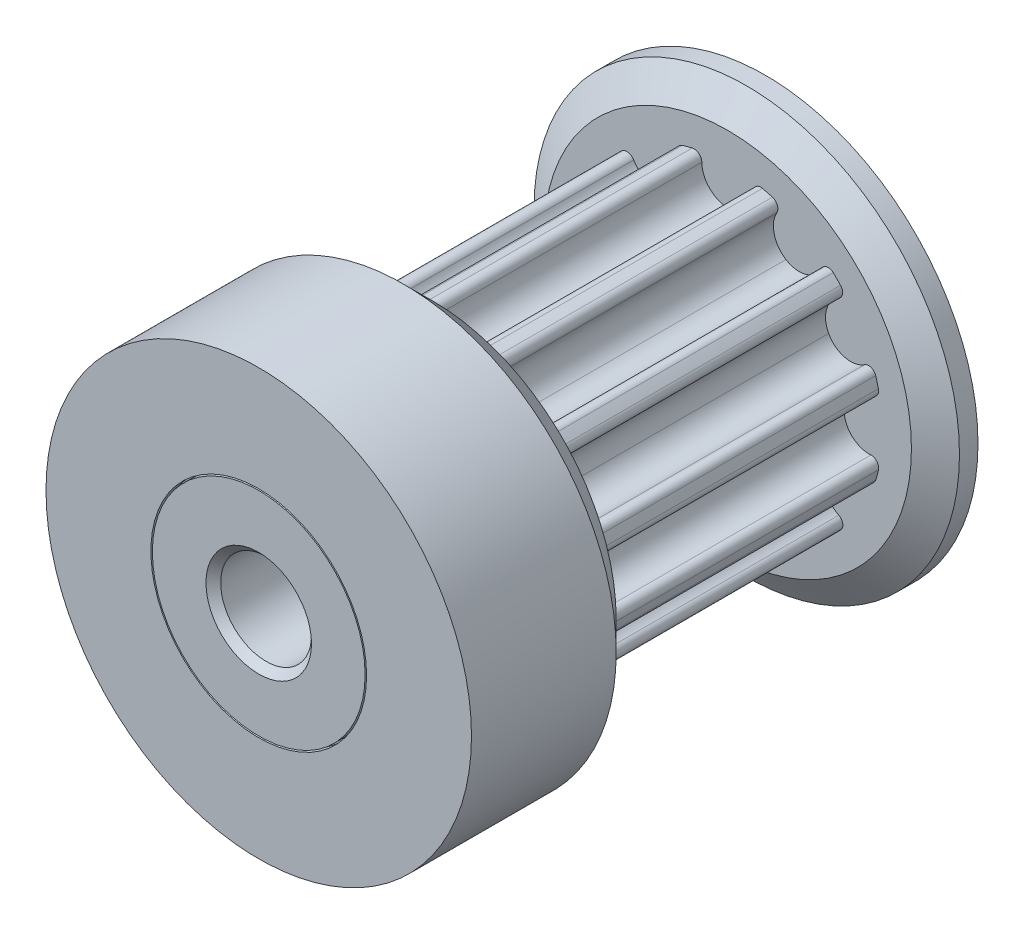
ISO-10303-21;
HEADER;
FILE_DESCRIPTION(('STEP AP214'),'2;1');
FILE_NAME('part.step','',(''),(''),'','','');
FILE_SCHEMA(('AUTOMOTIVE_DESIGN { 1 0 10303 214 1 1 1 1 }'));
ENDSEC;
DATA;
#1=APPLICATION_CONTEXT('core data for automotive mechanical design processes');
#2=APPLICATION_PROTOCOL_DEFINITION('international standard','automotive_design',2000,#1);
#3=PRODUCT_CONTEXT('',#1,'mechanical');
#4=PRODUCT('Part','Part','',(#3));
#5=PRODUCT_RELATED_PRODUCT_CATEGORY('part','',(#4));
#6=PRODUCT_DEFINITION_FORMATION('','',#4);
#7=PRODUCT_DEFINITION_CONTEXT('part definition',#1,'design');
#8=PRODUCT_DEFINITION('design','',#6,#7);
#9=PRODUCT_DEFINITION_SHAPE('','',#8);
#10=(LENGTH_UNIT() NAMED_UNIT(*) SI_UNIT(.MILLI.,.METRE.));
#11=(NAMED_UNIT(*) PLANE_ANGLE_UNIT() SI_UNIT($,.RADIAN.));
#12=(NAMED_UNIT(*) SI_UNIT($,.STERADIAN.) SOLID_ANGLE_UNIT());
#13=UNCERTAINTY_MEASURE_WITH_UNIT(LENGTH_MEASURE(1.E-05),#10,'distance_accuracy_value','');
#14=(GEOMETRIC_REPRESENTATION_CONTEXT(3) GLOBAL_UNCERTAINTY_ASSIGNED_CONTEXT((#13)) GLOBAL_UNIT_ASSIGNED_CONTEXT((#10,
#11,#12)) REPRESENTATION_CONTEXT('',''));
#15=CARTESIAN_POINT('',(0.,0.,0.));
#16=DIRECTION('',(0.,0.,1.));
#17=DIRECTION('',(1.,0.,0.));
#18=AXIS2_PLACEMENT_3D('',#15,#16,#17);
#19=CARTESIAN_POINT('',(-0.03264376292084,-4.95406842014,0.));
#20=DIRECTION('',(0.,0.,1.));
#21=DIRECTION('',(1.,0.,0.));
#22=AXIS2_PLACEMENT_3D('',#19,#20,#21);
#23=CYLINDRICAL_SURFACE('',#22,0.9249066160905);
#24=DIRECTION('',(0.,0.,1.));
#25=VECTOR('',#24,1.);
#26=CARTESIAN_POINT('',(0.,-4.02973804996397,0.));
#27=LINE('',#26,#25);
#28=CARTESIAN_POINT('',(1.08725149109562E-13,-4.02973804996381,0.));
#29=VERTEX_POINT('',#28);
#30=CARTESIAN_POINT('',(1.08725149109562E-13,-4.02973804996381,-10.2));
#31=VERTEX_POINT('',#30);
#32=EDGE_CURVE('E395',#29,#31,#27,.F.);
#33=ORIENTED_EDGE('',*,*,#32,.T.);
#34=CARTESIAN_POINT('',(-0.03264376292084,-4.95406842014,-10.2));
#35=DIRECTION('',(0.,0.,1.));
#36=DIRECTION('',(1.,0.,0.));
#37=AXIS2_PLACEMENT_3D('',#34,#35,#36);
#38=CIRCLE('',#37,0.9249066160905);
#39=CARTESIAN_POINT('',(0.892249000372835,-4.94900631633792,-10.2));
#40=VERTEX_POINT('',#39);
#41=EDGE_CURVE('E20',#40,#31,#38,.T.);
#42=ORIENTED_EDGE('',*,*,#41,.F.);
#43=DIRECTION('',(0.,0.,1.));
#44=VECTOR('',#43,1.);
#45=CARTESIAN_POINT('',(0.892249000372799,-4.94900631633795,0.));
#46=LINE('',#45,#44);
#47=CARTESIAN_POINT('',(0.892249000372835,-4.94900631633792,0.));
#48=VERTEX_POINT('',#47);
#49=EDGE_CURVE('E393',#48,#40,#46,.F.);
#50=ORIENTED_EDGE('',*,*,#49,.F.);
#51=CARTESIAN_POINT('',(-0.03264376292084,-4.95406842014,0.));
#52=DIRECTION('',(0.,0.,1.));
#53=DIRECTION('',(1.,0.,0.));
#54=AXIS2_PLACEMENT_3D('',#51,#52,#53);
#55=CIRCLE('',#54,0.9249066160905);
#56=EDGE_CURVE('E401',#29,#48,#55,.F.);
#57=ORIENTED_EDGE('',*,*,#56,.F.);
#58=EDGE_LOOP('',(#33,#42,#50,#57));
#59=FACE_BOUND('',#58,.T.);
#60=ADVANCED_FACE('F17',(#59),#23,.F.);
#61=CARTESIAN_POINT('',(1.160438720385,-4.94753846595,0.));
#62=DIRECTION('',(0.,0.,1.));
#63=DIRECTION('',(1.,0.,0.));
#64=AXIS2_PLACEMENT_3D('',#61,#62,#63);
#65=CYLINDRICAL_SURFACE('',#64,0.2681937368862);
#66=DIRECTION('',(0.,0.,-1.));
#67=VECTOR('',#66,1.);
#68=CARTESIAN_POINT('',(1.22168119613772,-5.20864618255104,6.));
#69=LINE('',#68,#67);
#70=CARTESIAN_POINT('',(1.2216811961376,-5.20864618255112,0.));
#71=VERTEX_POINT('',#70);
#72=CARTESIAN_POINT('',(1.2216811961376,-5.20864618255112,-10.2));
#73=VERTEX_POINT('',#72);
#74=EDGE_CURVE('E437',#71,#73,#69,.T.);
#75=ORIENTED_EDGE('',*,*,#74,.F.);
#76=CARTESIAN_POINT('',(1.160438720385,-4.94753846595,0.));
#77=DIRECTION('',(0.,0.,1.));
#78=DIRECTION('',(1.,0.,0.));
#79=AXIS2_PLACEMENT_3D('',#76,#77,#78);
#80=CIRCLE('',#79,0.2681937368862);
#81=EDGE_CURVE('E408',#71,#48,#80,.F.);
#82=ORIENTED_EDGE('',*,*,#81,.T.);
#83=ORIENTED_EDGE('',*,*,#49,.T.);
#84=CARTESIAN_POINT('',(1.160438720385,-4.94753846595,-10.2));
#85=DIRECTION('',(0.,0.,1.));
#86=DIRECTION('',(1.,0.,0.));
#87=AXIS2_PLACEMENT_3D('',#84,#85,#86);
#88=CIRCLE('',#87,0.2681937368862);
#89=EDGE_CURVE('E406',#40,#73,#88,.T.);
#90=ORIENTED_EDGE('',*,*,#89,.T.);
#91=EDGE_LOOP('',(#75,#82,#83,#90));
#92=FACE_BOUND('',#91,.T.);
#93=ADVANCED_FACE('F405',(#92),#65,.T.);
#94=CARTESIAN_POINT('',(-0.03048,-4.8928,0.));
#95=DIRECTION('',(0.,0.,1.));
#96=DIRECTION('',(1.,0.,0.));
#97=AXIS2_PLACEMENT_3D('',#94,#95,#96);
#98=CYLINDRICAL_SURFACE('',#97,0.8636);
#99=DIRECTION('',(0.,0.,1.));
#100=VECTOR('',#99,1.);
#101=CARTESIAN_POINT('',(-0.89224900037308,-4.94900631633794,0.));
#102=LINE('',#101,#100);
#103=CARTESIAN_POINT('',(-0.892249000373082,-4.9490063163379,-10.2));
#104=VERTEX_POINT('',#103);
#105=CARTESIAN_POINT('',(-0.892249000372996,-4.9490063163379,0.));
#106=VERTEX_POINT('',#105);
#107=EDGE_CURVE('E922',#104,#106,#102,.T.);
#108=ORIENTED_EDGE('',*,*,#107,.F.);
#109=CARTESIAN_POINT('',(-0.03048,-4.8928,-10.2));
#110=DIRECTION('',(0.,0.,1.));
#111=DIRECTION('',(1.,0.,0.));
#112=AXIS2_PLACEMENT_3D('',#109,#110,#111);
#113=CIRCLE('',#112,0.8636);
#114=EDGE_CURVE('E432',#31,#104,#113,.T.);
#115=ORIENTED_EDGE('',*,*,#114,.F.);
#116=ORIENTED_EDGE('',*,*,#32,.F.);
#117=CARTESIAN_POINT('',(-0.03048,-4.8928,0.));
#118=DIRECTION('',(0.,0.,1.));
#119=DIRECTION('',(1.,0.,0.));
#120=AXIS2_PLACEMENT_3D('',#117,#118,#119);
#121=CIRCLE('',#120,0.8636);
#122=EDGE_CURVE('E427',#106,#29,#121,.F.);
#123=ORIENTED_EDGE('',*,*,#122,.F.);
#124=EDGE_LOOP('',(#108,#115,#116,#123));
#125=FACE_BOUND('',#124,.T.);
#126=ADVANCED_FACE('F430',(#125),#98,.F.);
#127=CARTESIAN_POINT('',(0.,0.,6.));
#128=DIRECTION('',(0.,0.,-1.));
#129=DIRECTION('',(-1.,0.,0.));
#130=AXIS2_PLACEMENT_3D('',#127,#128,#129);
#131=CYLINDRICAL_SURFACE('',#130,5.35);
#132=DIRECTION('',(0.,0.,1.));
#133=VECTOR('',#132,1.);
#134=CARTESIAN_POINT('',(1.56484814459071,-5.11602876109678,0.));
#135=LINE('',#134,#133);
#136=CARTESIAN_POINT('',(1.56484814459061,-5.11602876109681,0.));
#137=VERTEX_POINT('',#136);
#138=CARTESIAN_POINT('',(1.56484814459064,-5.11602876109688,-10.2));
#139=VERTEX_POINT('',#138);
#140=EDGE_CURVE('E918',#137,#139,#135,.F.);
#141=ORIENTED_EDGE('',*,*,#140,.F.);
#142=CARTESIAN_POINT('',(0.,0.,0.));
#143=DIRECTION('',(0.,0.,-1.));
#144=DIRECTION('',(-1.,0.,0.));
#145=AXIS2_PLACEMENT_3D('',#142,#143,#144);
#146=CIRCLE('',#145,5.35);
#147=EDGE_CURVE('E919',#137,#71,#146,.T.);
#148=ORIENTED_EDGE('',*,*,#147,.T.);
#149=ORIENTED_EDGE('',*,*,#74,.T.);
#150=CARTESIAN_POINT('',(0.,0.,-10.2));
#151=DIRECTION('',(0.,0.,-1.));
#152=DIRECTION('',(-1.,0.,0.));
#153=AXIS2_PLACEMENT_3D('',#150,#151,#152);
#154=CIRCLE('',#153,5.35);
#155=EDGE_CURVE('E414',#73,#139,#154,.F.);
#156=ORIENTED_EDGE('',*,*,#155,.T.);
#157=EDGE_LOOP('',(#141,#148,#149,#156));
#158=FACE_BOUND('',#157,.T.);
#159=ADVANCED_FACE('F929',(#158),#131,.T.);
#160=CARTESIAN_POINT('',(-1.145710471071,-4.965537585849,0.));
#161=DIRECTION('',(0.,0.,1.));
#162=DIRECTION('',(1.,0.,0.));
#163=AXIS2_PLACEMENT_3D('',#160,#161,#162);
#164=CYLINDRICAL_SURFACE('',#163,0.254);
#165=CARTESIAN_POINT('',(-1.145710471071,-4.965537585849,0.));
#166=DIRECTION('',(0.,0.,1.));
#167=DIRECTION('',(1.,0.,0.));
#168=AXIS2_PLACEMENT_3D('',#165,#166,#167);
#169=CIRCLE('',#168,0.254);
#170=CARTESIAN_POINT('',(-1.20281613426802,-5.21303494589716,0.));
#171=VERTEX_POINT('',#170);
#172=EDGE_CURVE('E912',#106,#171,#169,.F.);
#173=ORIENTED_EDGE('',*,*,#172,.T.);
#174=DIRECTION('',(0.,0.,-1.));
#175=VECTOR('',#174,1.);
#176=CARTESIAN_POINT('',(-1.20281613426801,-5.21303494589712,6.));
#177=LINE('',#176,#175);
#178=CARTESIAN_POINT('',(-1.20281613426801,-5.21303494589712,-10.2));
#179=VERTEX_POINT('',#178);
#180=EDGE_CURVE('E902',#179,#171,#177,.F.);
#181=ORIENTED_EDGE('',*,*,#180,.F.);
#182=CARTESIAN_POINT('',(-1.145710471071,-4.965537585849,-10.2));
#183=DIRECTION('',(0.,0.,1.));
#184=DIRECTION('',(1.,0.,0.));
#185=AXIS2_PLACEMENT_3D('',#182,#183,#184);
#186=CIRCLE('',#185,0.254);
#187=EDGE_CURVE('E915',#179,#104,#186,.T.);
#188=ORIENTED_EDGE('',*,*,#187,.T.);
#189=ORIENTED_EDGE('',*,*,#107,.T.);
#190=EDGE_LOOP('',(#173,#181,#188,#189));
#191=FACE_BOUND('',#190,.T.);
#192=ADVANCED_FACE('F952',(#191),#164,.T.);
#193=CARTESIAN_POINT('',(1.490554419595,-4.873136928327,0.));
#194=DIRECTION('',(0.,0.,1.));
#195=DIRECTION('',(1.,0.,0.));
#196=AXIS2_PLACEMENT_3D('',#193,#194,#195);
#197=CYLINDRICAL_SURFACE('',#196,0.254);
#198=DIRECTION('',(0.,0.,1.));
#199=VECTOR('',#198,1.);
#200=CARTESIAN_POINT('',(1.70179285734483,-4.73208969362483,0.));
#201=LINE('',#200,#199);
#202=CARTESIAN_POINT('',(1.70179285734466,-4.73208969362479,-10.2));
#203=VERTEX_POINT('',#202);
#204=CARTESIAN_POINT('',(1.70179285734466,-4.73208969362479,0.));
#205=VERTEX_POINT('',#204);
#206=EDGE_CURVE('E894',#203,#205,#201,.T.);
#207=ORIENTED_EDGE('',*,*,#206,.T.);
#208=CARTESIAN_POINT('',(1.490554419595,-4.873136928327,0.));
#209=DIRECTION('',(0.,0.,1.));
#210=DIRECTION('',(1.,0.,0.));
#211=AXIS2_PLACEMENT_3D('',#208,#209,#210);
#212=CIRCLE('',#211,0.254);
#213=EDGE_CURVE('E906',#205,#137,#212,.F.);
#214=ORIENTED_EDGE('',*,*,#213,.T.);
#215=ORIENTED_EDGE('',*,*,#140,.T.);
#216=CARTESIAN_POINT('',(1.490554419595,-4.873136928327,-10.2));
#217=DIRECTION('',(0.,0.,1.));
#218=DIRECTION('',(1.,0.,0.));
#219=AXIS2_PLACEMENT_3D('',#216,#217,#218);
#220=CIRCLE('',#219,0.254);
#221=EDGE_CURVE('E909',#139,#203,#220,.T.);
#222=ORIENTED_EDGE('',*,*,#221,.T.);
#223=EDGE_LOOP('',(#207,#214,#215,#222));
#224=FACE_BOUND('',#223,.T.);
#225=ADVANCED_FACE('F940',(#224),#197,.T.);
#226=CARTESIAN_POINT('',(0.,0.,6.));
#227=DIRECTION('',(0.,0.,-1.));
#228=DIRECTION('',(-1.,0.,0.));
#229=AXIS2_PLACEMENT_3D('',#226,#227,#228);
#230=CYLINDRICAL_SURFACE('',#229,5.35);
#231=ORIENTED_EDGE('',*,*,#180,.T.);
#232=CARTESIAN_POINT('',(0.,0.,0.));
#233=DIRECTION('',(0.,0.,-1.));
#234=DIRECTION('',(-1.,0.,0.));
#235=AXIS2_PLACEMENT_3D('',#232,#233,#234);
#236=CIRCLE('',#235,5.35);
#237=CARTESIAN_POINT('',(-1.54631614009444,-5.12166051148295,0.));
#238=VERTEX_POINT('',#237);
#239=EDGE_CURVE('E899',#171,#238,#236,.T.);
#240=ORIENTED_EDGE('',*,*,#239,.T.);
#241=DIRECTION('',(0.,0.,1.));
#242=VECTOR('',#241,1.);
#243=CARTESIAN_POINT('',(-1.54631614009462,-5.12166051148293,0.));
#244=LINE('',#243,#242);
#245=CARTESIAN_POINT('',(-1.54631614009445,-5.12166051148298,-10.2));
#246=VERTEX_POINT('',#245);
#247=EDGE_CURVE('E887',#246,#238,#244,.T.);
#248=ORIENTED_EDGE('',*,*,#247,.F.);
#249=CARTESIAN_POINT('',(0.,0.,-10.2));
#250=DIRECTION('',(0.,0.,-1.));
#251=DIRECTION('',(-1.,0.,0.));
#252=AXIS2_PLACEMENT_3D('',#249,#250,#251);
#253=CIRCLE('',#252,5.35);
#254=EDGE_CURVE('E903',#246,#179,#253,.F.);
#255=ORIENTED_EDGE('',*,*,#254,.T.);
#256=EDGE_LOOP('',(#231,#240,#248,#255));
#257=FACE_BOUND('',#256,.T.);
#258=ADVANCED_FACE('F961',(#257),#230,.T.);
#259=CARTESIAN_POINT('',(2.420003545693,-4.252529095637,0.));
#260=DIRECTION('',(0.,0.,1.));
#261=DIRECTION('',(1.,0.,0.));
#262=AXIS2_PLACEMENT_3D('',#259,#260,#261);
#263=CYLINDRICAL_SURFACE('',#262,0.8636);
#264=ORIENTED_EDGE('',*,*,#206,.F.);
#265=CARTESIAN_POINT('',(2.420003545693,-4.252529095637,-10.2));
#266=DIRECTION('',(0.,0.,1.));
#267=DIRECTION('',(1.,0.,0.));
#268=AXIS2_PLACEMENT_3D('',#265,#266,#267);
#269=CIRCLE('',#268,0.8636);
#270=CARTESIAN_POINT('',(2.01486902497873,-3.48985552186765,-10.2));
#271=VERTEX_POINT('',#270);
#272=EDGE_CURVE('E895',#271,#203,#269,.T.);
#273=ORIENTED_EDGE('',*,*,#272,.F.);
#274=DIRECTION('',(0.,0.,1.));
#275=VECTOR('',#274,1.);
#276=CARTESIAN_POINT('',(2.01486902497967,-3.48985552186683,0.));
#277=LINE('',#276,#275);
#278=CARTESIAN_POINT('',(2.01486902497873,-3.48985552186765,0.));
#279=VERTEX_POINT('',#278);
#280=EDGE_CURVE('E878',#271,#279,#277,.T.);
#281=ORIENTED_EDGE('',*,*,#280,.T.);
#282=CARTESIAN_POINT('',(2.420003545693,-4.252529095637,0.));
#283=DIRECTION('',(0.,0.,1.));
#284=DIRECTION('',(1.,0.,0.));
#285=AXIS2_PLACEMENT_3D('',#282,#283,#284);
#286=CIRCLE('',#285,0.8636);
#287=EDGE_CURVE('E891',#205,#279,#286,.F.);
#288=ORIENTED_EDGE('',*,*,#287,.F.);
#289=EDGE_LOOP('',(#264,#273,#281,#288));
#290=FACE_BOUND('',#289,.T.);
#291=ADVANCED_FACE('F938',(#290),#263,.F.);
#292=CARTESIAN_POINT('',(-1.468799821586,-4.864913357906,0.));
#293=DIRECTION('',(0.,0.,1.));
#294=DIRECTION('',(1.,0.,0.));
#295=AXIS2_PLACEMENT_3D('',#292,#293,#294);
#296=CYLINDRICAL_SURFACE('',#295,0.2681937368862);
#297=ORIENTED_EDGE('',*,*,#247,.T.);
#298=CARTESIAN_POINT('',(-1.468799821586,-4.864913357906,0.));
#299=DIRECTION('',(0.,0.,1.));
#300=DIRECTION('',(1.,0.,0.));
#301=AXIS2_PLACEMENT_3D('',#298,#299,#300);
#302=CIRCLE('',#301,0.2681937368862);
#303=CARTESIAN_POINT('',(-1.70179285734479,-4.73208969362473,0.));
#304=VERTEX_POINT('',#303);
#305=EDGE_CURVE('E883',#238,#304,#302,.F.);
#306=ORIENTED_EDGE('',*,*,#305,.T.);
#307=DIRECTION('',(0.,0.,1.));
#308=VECTOR('',#307,1.);
#309=CARTESIAN_POINT('',(-1.7017928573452,-4.73208969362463,0.));
#310=LINE('',#309,#308);
#311=CARTESIAN_POINT('',(-1.70179285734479,-4.73208969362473,-10.2));
#312=VERTEX_POINT('',#311);
#313=EDGE_CURVE('E877',#304,#312,#310,.F.);
#314=ORIENTED_EDGE('',*,*,#313,.T.);
#315=CARTESIAN_POINT('',(-1.468799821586,-4.864913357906,-10.2));
#316=DIRECTION('',(0.,0.,1.));
#317=DIRECTION('',(1.,0.,0.));
#318=AXIS2_PLACEMENT_3D('',#315,#316,#317);
#319=CIRCLE('',#318,0.2681937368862);
#320=EDGE_CURVE('E888',#312,#246,#319,.T.);
#321=ORIENTED_EDGE('',*,*,#320,.T.);
#322=EDGE_LOOP('',(#297,#306,#314,#321));
#323=FACE_BOUND('',#322,.T.);
#324=ADVANCED_FACE('F1779',(#323),#296,.T.);
#325=CARTESIAN_POINT('',(2.448763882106,-4.306670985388,0.));
#326=DIRECTION('',(0.,0.,1.));
#327=DIRECTION('',(1.,0.,0.));
#328=AXIS2_PLACEMENT_3D('',#325,#326,#327);
#329=CYLINDRICAL_SURFACE('',#328,0.9249066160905);
#330=ORIENTED_EDGE('',*,*,#280,.F.);
#331=CARTESIAN_POINT('',(2.448763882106,-4.306670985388,-10.2));
#332=DIRECTION('',(0.,0.,1.));
#333=DIRECTION('',(1.,0.,0.));
#334=AXIS2_PLACEMENT_3D('',#331,#332,#333);
#335=CIRCLE('',#334,0.9249066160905);
#336=CARTESIAN_POINT('',(3.24721345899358,-3.83984069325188,-10.2));
#337=VERTEX_POINT('',#336);
#338=EDGE_CURVE('E879',#337,#271,#335,.T.);
#339=ORIENTED_EDGE('',*,*,#338,.F.);
#340=DIRECTION('',(0.,0.,1.));
#341=VECTOR('',#340,1.);
#342=CARTESIAN_POINT('',(3.24721345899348,-3.83984069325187,0.));
#343=LINE('',#342,#341);
#344=CARTESIAN_POINT('',(3.24721345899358,-3.83984069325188,0.));
#345=VERTEX_POINT('',#344);
#346=EDGE_CURVE('E873',#345,#337,#343,.F.);
#347=ORIENTED_EDGE('',*,*,#346,.F.);
#348=CARTESIAN_POINT('',(2.448763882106,-4.306670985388,0.));
#349=DIRECTION('',(0.,0.,1.));
#350=DIRECTION('',(1.,0.,0.));
#351=AXIS2_PLACEMENT_3D('',#348,#349,#350);
#352=CIRCLE('',#351,0.9249066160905);
#353=EDGE_CURVE('E874',#279,#345,#352,.F.);
#354=ORIENTED_EDGE('',*,*,#353,.F.);
#355=EDGE_LOOP('',(#330,#339,#347,#354));
#356=FACE_BOUND('',#355,.T.);
#357=ADVANCED_FACE('F1770',(#356),#329,.F.);
#358=CARTESIAN_POINT('',(3.478738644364,-3.704474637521,0.));
#359=DIRECTION('',(0.,0.,1.));
#360=DIRECTION('',(1.,0.,0.));
#361=AXIS2_PLACEMENT_3D('',#358,#359,#360);
#362=CYLINDRICAL_SURFACE('',#361,0.2681937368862);
#363=DIRECTION('',(0.,0.,-1.));
#364=VECTOR('',#363,1.);
#365=CARTESIAN_POINT('',(3.66233004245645,-3.89997931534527,6.));
#366=LINE('',#365,#364);
#367=CARTESIAN_POINT('',(3.66233004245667,-3.89997931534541,0.));
#368=VERTEX_POINT('',#367);
#369=CARTESIAN_POINT('',(3.66233004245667,-3.89997931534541,-10.2));
#370=VERTEX_POINT('',#369);
#371=EDGE_CURVE('E859',#368,#370,#366,.T.);
#372=ORIENTED_EDGE('',*,*,#371,.F.);
#373=CARTESIAN_POINT('',(3.478738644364,-3.704474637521,0.));
#374=DIRECTION('',(0.,0.,1.));
#375=DIRECTION('',(1.,0.,0.));
#376=AXIS2_PLACEMENT_3D('',#373,#374,#375);
#377=CIRCLE('',#376,0.2681937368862);
#378=EDGE_CURVE('E866',#368,#345,#377,.F.);
#379=ORIENTED_EDGE('',*,*,#378,.T.);
#380=ORIENTED_EDGE('',*,*,#346,.T.);
#381=CARTESIAN_POINT('',(3.478738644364,-3.704474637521,-10.2));
#382=DIRECTION('',(0.,0.,1.));
#383=DIRECTION('',(1.,0.,0.));
#384=AXIS2_PLACEMENT_3D('',#381,#382,#383);
#385=CIRCLE('',#384,0.2681937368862);
#386=EDGE_CURVE('E870',#337,#370,#385,.T.);
#387=ORIENTED_EDGE('',*,*,#386,.T.);
#388=EDGE_LOOP('',(#372,#379,#380,#387));
#389=FACE_BOUND('',#388,.T.);
#390=ADVANCED_FACE('F1761',(#389),#362,.T.);
#391=CARTESIAN_POINT('',(-2.505304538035,-4.274027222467,0.));
#392=DIRECTION('',(0.,0.,1.));
#393=DIRECTION('',(1.,0.,0.));
#394=AXIS2_PLACEMENT_3D('',#391,#392,#393);
#395=CYLINDRICAL_SURFACE('',#394,0.9249066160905);
#396=CARTESIAN_POINT('',(-2.505304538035,-4.274027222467,-10.2));
#397=DIRECTION('',(0.,0.,1.));
#398=DIRECTION('',(1.,0.,0.));
#399=AXIS2_PLACEMENT_3D('',#396,#397,#398);
#400=CIRCLE('',#399,0.9249066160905);
#401=CARTESIAN_POINT('',(-2.0148690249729,-3.4898555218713,-10.2));
#402=VERTEX_POINT('',#401);
#403=EDGE_CURVE('E860',#312,#402,#400,.T.);
#404=ORIENTED_EDGE('',*,*,#403,.F.);
#405=ORIENTED_EDGE('',*,*,#313,.F.);
#406=CARTESIAN_POINT('',(-2.505304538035,-4.274027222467,0.));
#407=DIRECTION('',(0.,0.,1.));
#408=DIRECTION('',(1.,0.,0.));
#409=AXIS2_PLACEMENT_3D('',#406,#407,#408);
#410=CIRCLE('',#409,0.9249066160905);
#411=CARTESIAN_POINT('',(-2.0148690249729,-3.4898555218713,0.));
#412=VERTEX_POINT('',#411);
#413=EDGE_CURVE('E863',#412,#304,#410,.F.);
#414=ORIENTED_EDGE('',*,*,#413,.F.);
#415=DIRECTION('',(0.,0.,1.));
#416=VECTOR('',#415,1.);
#417=CARTESIAN_POINT('',(-2.01486902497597,-3.4898555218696,0.));
#418=LINE('',#417,#416);
#419=EDGE_CURVE('E850',#412,#402,#418,.F.);
#420=ORIENTED_EDGE('',*,*,#419,.T.);
#421=EDGE_LOOP('',(#404,#405,#414,#420));
#422=FACE_BOUND('',#421,.T.);
#423=ADVANCED_FACE('F1752',(#422),#395,.F.);
#424=CARTESIAN_POINT('',(0.,0.,6.));
#425=DIRECTION('',(0.,0.,-1.));
#426=DIRECTION('',(-1.,0.,0.));
#427=AXIS2_PLACEMENT_3D('',#424,#425,#426);
#428=CYLINDRICAL_SURFACE('',#427,5.35);
#429=DIRECTION('',(0.,0.,1.));
#430=VECTOR('',#429,1.);
#431=CARTESIAN_POINT('',(3.91321262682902,-3.64818680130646,0.));
#432=LINE('',#431,#430);
#433=CARTESIAN_POINT('',(3.91321262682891,-3.64818680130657,0.));
#434=VERTEX_POINT('',#433);
#435=CARTESIAN_POINT('',(3.91321262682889,-3.64818680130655,-10.2));
#436=VERTEX_POINT('',#435);
#437=EDGE_CURVE('E841',#434,#436,#432,.F.);
#438=ORIENTED_EDGE('',*,*,#437,.F.);
#439=CARTESIAN_POINT('',(0.,0.,0.));
#440=DIRECTION('',(0.,0.,-1.));
#441=DIRECTION('',(-1.,0.,0.));
#442=AXIS2_PLACEMENT_3D('',#439,#440,#441);
#443=CIRCLE('',#442,5.35);
#444=EDGE_CURVE('E851',#434,#368,#443,.T.);
#445=ORIENTED_EDGE('',*,*,#444,.T.);
#446=ORIENTED_EDGE('',*,*,#371,.T.);
#447=CARTESIAN_POINT('',(0.,0.,-10.2));
#448=DIRECTION('',(0.,0.,-1.));
#449=DIRECTION('',(-1.,0.,0.));
#450=AXIS2_PLACEMENT_3D('',#447,#448,#449);
#451=CIRCLE('',#450,5.35);
#452=EDGE_CURVE('E855',#370,#436,#451,.F.);
#453=ORIENTED_EDGE('',*,*,#452,.T.);
#454=EDGE_LOOP('',(#438,#445,#446,#453));
#455=FACE_BOUND('',#454,.T.);
#456=ADVANCED_FACE('F1743',(#455),#428,.T.);
#457=CARTESIAN_POINT('',(-2.472796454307,-4.222049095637,0.));
#458=DIRECTION('',(0.,0.,1.));
#459=DIRECTION('',(1.,0.,0.));
#460=AXIS2_PLACEMENT_3D('',#457,#458,#459);
#461=CYLINDRICAL_SURFACE('',#460,0.8636);
#462=DIRECTION('',(0.,0.,1.));
#463=VECTOR('',#462,1.);
#464=CARTESIAN_POINT('',(-3.24721345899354,-3.83984069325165,0.));
#465=LINE('',#464,#463);
#466=CARTESIAN_POINT('',(-3.24721345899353,-3.83984069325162,-10.2));
#467=VERTEX_POINT('',#466);
#468=CARTESIAN_POINT('',(-3.2472134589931,-3.83984069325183,0.));
#469=VERTEX_POINT('',#468);
#470=EDGE_CURVE('E837',#467,#469,#465,.T.);
#471=ORIENTED_EDGE('',*,*,#470,.F.);
#472=CARTESIAN_POINT('',(-2.472796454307,-4.222049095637,-10.2));
#473=DIRECTION('',(0.,0.,1.));
#474=DIRECTION('',(1.,0.,0.));
#475=AXIS2_PLACEMENT_3D('',#472,#473,#474);
#476=CIRCLE('',#475,0.8636);
#477=EDGE_CURVE('E846',#402,#467,#476,.T.);
#478=ORIENTED_EDGE('',*,*,#477,.F.);
#479=ORIENTED_EDGE('',*,*,#419,.F.);
#480=CARTESIAN_POINT('',(-2.472796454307,-4.222049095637,0.));
#481=DIRECTION('',(0.,0.,1.));
#482=DIRECTION('',(1.,0.,0.));
#483=AXIS2_PLACEMENT_3D('',#480,#481,#482);
#484=CIRCLE('',#483,0.8636);
#485=EDGE_CURVE('E842',#469,#412,#484,.F.);
#486=ORIENTED_EDGE('',*,*,#485,.F.);
#487=EDGE_LOOP('',(#471,#478,#479,#486));
#488=FACE_BOUND('',#487,.T.);
#489=ADVANCED_FACE('F1734',(#488),#461,.F.);
#490=CARTESIAN_POINT('',(-3.474983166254,-3.727426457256,0.));
#491=DIRECTION('',(0.,0.,1.));
#492=DIRECTION('',(1.,0.,0.));
#493=AXIS2_PLACEMENT_3D('',#490,#491,#492);
#494=CYLINDRICAL_SURFACE('',#493,0.254);
#495=ORIENTED_EDGE('',*,*,#470,.T.);
#496=CARTESIAN_POINT('',(-3.474983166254,-3.727426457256,0.));
#497=DIRECTION('',(0.,0.,1.));
#498=DIRECTION('',(1.,0.,0.));
#499=AXIS2_PLACEMENT_3D('',#496,#497,#498);
#500=CIRCLE('',#499,0.254);
#501=CARTESIAN_POINT('',(-3.64818680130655,-3.91321262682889,0.));
#502=VERTEX_POINT('',#501);
#503=EDGE_CURVE('E834',#469,#502,#500,.F.);
#504=ORIENTED_EDGE('',*,*,#503,.T.);
#505=DIRECTION('',(0.,0.,-1.));
#506=VECTOR('',#505,1.);
#507=CARTESIAN_POINT('',(-3.64818680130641,-3.91321262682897,6.));
#508=LINE('',#507,#506);
#509=CARTESIAN_POINT('',(-3.64818680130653,-3.91321262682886,-10.2));
#510=VERTEX_POINT('',#509);
#511=EDGE_CURVE('E824',#510,#502,#508,.F.);
#512=ORIENTED_EDGE('',*,*,#511,.F.);
#513=CARTESIAN_POINT('',(-3.474983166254,-3.727426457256,-10.2));
#514=DIRECTION('',(0.,0.,1.));
#515=DIRECTION('',(1.,0.,0.));
#516=AXIS2_PLACEMENT_3D('',#513,#514,#515);
#517=CIRCLE('',#516,0.254);
#518=EDGE_CURVE('E838',#510,#467,#517,.T.);
#519=ORIENTED_EDGE('',*,*,#518,.T.);
#520=EDGE_LOOP('',(#495,#504,#512,#519));
#521=FACE_BOUND('',#520,.T.);
#522=ADVANCED_FACE('F1725',(#521),#494,.T.);
#523=CARTESIAN_POINT('',(3.727426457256,-3.474983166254,0.));
#524=DIRECTION('',(0.,0.,1.));
#525=DIRECTION('',(1.,0.,0.));
#526=AXIS2_PLACEMENT_3D('',#523,#524,#525);
#527=CYLINDRICAL_SURFACE('',#526,0.254);
#528=DIRECTION('',(0.,0.,1.));
#529=VECTOR('',#528,1.);
#530=CARTESIAN_POINT('',(3.83984069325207,-3.24721345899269,0.));
#531=LINE('',#530,#529);
#532=CARTESIAN_POINT('',(3.83984069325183,-3.2472134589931,-10.2));
#533=VERTEX_POINT('',#532);
#534=CARTESIAN_POINT('',(3.83984069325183,-3.2472134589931,0.));
#535=VERTEX_POINT('',#534);
#536=EDGE_CURVE('E816',#533,#535,#531,.T.);
#537=ORIENTED_EDGE('',*,*,#536,.T.);
#538=CARTESIAN_POINT('',(3.727426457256,-3.474983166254,0.));
#539=DIRECTION('',(0.,0.,1.));
#540=DIRECTION('',(1.,0.,0.));
#541=AXIS2_PLACEMENT_3D('',#538,#539,#540);
#542=CIRCLE('',#541,0.254);
#543=EDGE_CURVE('E828',#535,#434,#542,.F.);
#544=ORIENTED_EDGE('',*,*,#543,.T.);
#545=ORIENTED_EDGE('',*,*,#437,.T.);
#546=CARTESIAN_POINT('',(3.727426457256,-3.474983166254,-10.2));
#547=DIRECTION('',(0.,0.,1.));
#548=DIRECTION('',(1.,0.,0.));
#549=AXIS2_PLACEMENT_3D('',#546,#547,#548);
#550=CIRCLE('',#549,0.254);
#551=EDGE_CURVE('E831',#436,#533,#550,.T.);
#552=ORIENTED_EDGE('',*,*,#551,.T.);
#553=EDGE_LOOP('',(#537,#544,#545,#552));
#554=FACE_BOUND('',#553,.T.);
#555=ADVANCED_FACE('F1716',(#554),#527,.T.);
#556=CARTESIAN_POINT('',(0.,0.,6.));
#557=DIRECTION('',(0.,0.,-1.));
#558=DIRECTION('',(-1.,0.,0.));
#559=AXIS2_PLACEMENT_3D('',#556,#557,#558);
#560=CYLINDRICAL_SURFACE('',#559,5.35);
#561=ORIENTED_EDGE('',*,*,#511,.T.);
#562=CARTESIAN_POINT('',(0.,0.,0.));
#563=DIRECTION('',(0.,0.,-1.));
#564=DIRECTION('',(-1.,0.,0.));
#565=AXIS2_PLACEMENT_3D('',#562,#563,#564);
#566=CIRCLE('',#565,5.35);
#567=CARTESIAN_POINT('',(-3.89997931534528,-3.66233004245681,0.));
#568=VERTEX_POINT('',#567);
#569=EDGE_CURVE('E821',#502,#568,#566,.T.);
#570=ORIENTED_EDGE('',*,*,#569,.T.);
#571=DIRECTION('',(0.,0.,1.));
#572=VECTOR('',#571,1.);
#573=CARTESIAN_POINT('',(-3.89997931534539,-3.66233004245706,0.));
#574=LINE('',#573,#572);
#575=CARTESIAN_POINT('',(-3.89997931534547,-3.66233004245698,-10.2));
#576=VERTEX_POINT('',#575);
#577=EDGE_CURVE('E809',#576,#568,#574,.T.);
#578=ORIENTED_EDGE('',*,*,#577,.F.);
#579=CARTESIAN_POINT('',(0.,0.,-10.2));
#580=DIRECTION('',(0.,0.,-1.));
#581=DIRECTION('',(-1.,0.,0.));
#582=AXIS2_PLACEMENT_3D('',#579,#580,#581);
#583=CIRCLE('',#582,5.35);
#584=EDGE_CURVE('E825',#576,#510,#583,.F.);
#585=ORIENTED_EDGE('',*,*,#584,.T.);
#586=EDGE_LOOP('',(#561,#570,#578,#585));
#587=FACE_BOUND('',#586,.T.);
#588=ADVANCED_FACE('F1707',(#587),#560,.T.);
#589=CARTESIAN_POINT('',(4.222049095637,-2.472796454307,0.));
#590=DIRECTION('',(0.,0.,1.));
#591=DIRECTION('',(1.,0.,0.));
#592=AXIS2_PLACEMENT_3D('',#589,#590,#591);
#593=CYLINDRICAL_SURFACE('',#592,0.8636);
#594=ORIENTED_EDGE('',*,*,#536,.F.);
#595=CARTESIAN_POINT('',(4.222049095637,-2.472796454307,-10.2));
#596=DIRECTION('',(0.,0.,1.));
#597=DIRECTION('',(1.,0.,0.));
#598=AXIS2_PLACEMENT_3D('',#595,#596,#597);
#599=CIRCLE('',#598,0.8636);
#600=CARTESIAN_POINT('',(3.4898555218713,-2.0148690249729,-10.2));
#601=VERTEX_POINT('',#600);
#602=EDGE_CURVE('E817',#601,#533,#599,.T.);
#603=ORIENTED_EDGE('',*,*,#602,.F.);
#604=DIRECTION('',(0.,0.,1.));
#605=VECTOR('',#604,1.);
#606=CARTESIAN_POINT('',(3.48985552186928,-2.01486902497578,0.));
#607=LINE('',#606,#605);
#608=CARTESIAN_POINT('',(3.4898555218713,-2.0148690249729,0.));
#609=VERTEX_POINT('',#608);
#610=EDGE_CURVE('E800',#601,#609,#607,.T.);
#611=ORIENTED_EDGE('',*,*,#610,.T.);
#612=CARTESIAN_POINT('',(4.222049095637,-2.472796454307,0.));
#613=DIRECTION('',(0.,0.,1.));
#614=DIRECTION('',(1.,0.,0.));
#615=AXIS2_PLACEMENT_3D('',#612,#613,#614);
#616=CIRCLE('',#615,0.8636);
#617=EDGE_CURVE('E813',#535,#609,#616,.F.);
#618=ORIENTED_EDGE('',*,*,#617,.F.);
#619=EDGE_LOOP('',(#594,#603,#611,#618));
#620=FACE_BOUND('',#619,.T.);
#621=ADVANCED_FACE('F1698',(#620),#593,.F.);
#622=CARTESIAN_POINT('',(-3.704474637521,-3.478738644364,0.));
#623=DIRECTION('',(0.,0.,1.));
#624=DIRECTION('',(1.,0.,0.));
#625=AXIS2_PLACEMENT_3D('',#622,#623,#624);
#626=CYLINDRICAL_SURFACE('',#625,0.2681937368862);
#627=ORIENTED_EDGE('',*,*,#577,.T.);
#628=CARTESIAN_POINT('',(-3.704474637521,-3.478738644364,0.));
#629=DIRECTION('',(0.,0.,1.));
#630=DIRECTION('',(1.,0.,0.));
#631=AXIS2_PLACEMENT_3D('',#628,#629,#630);
#632=CIRCLE('',#631,0.2681937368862);
#633=CARTESIAN_POINT('',(-3.83984069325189,-3.24721345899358,0.));
#634=VERTEX_POINT('',#633);
#635=EDGE_CURVE('E805',#568,#634,#632,.F.);
#636=ORIENTED_EDGE('',*,*,#635,.T.);
#637=DIRECTION('',(0.,0.,1.));
#638=VECTOR('',#637,1.);
#639=CARTESIAN_POINT('',(-3.83984069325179,-3.24721345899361,0.));
#640=LINE('',#639,#638);
#641=CARTESIAN_POINT('',(-3.83984069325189,-3.24721345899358,-10.2));
#642=VERTEX_POINT('',#641);
#643=EDGE_CURVE('E799',#634,#642,#640,.F.);
#644=ORIENTED_EDGE('',*,*,#643,.T.);
#645=CARTESIAN_POINT('',(-3.704474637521,-3.478738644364,-10.2));
#646=DIRECTION('',(0.,0.,1.));
#647=DIRECTION('',(1.,0.,0.));
#648=AXIS2_PLACEMENT_3D('',#645,#646,#647);
#649=CIRCLE('',#648,0.2681937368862);
#650=EDGE_CURVE('E810',#642,#576,#649,.T.);
#651=ORIENTED_EDGE('',*,*,#650,.T.);
#652=EDGE_LOOP('',(#627,#636,#644,#651));
#653=FACE_BOUND('',#652,.T.);
#654=ADVANCED_FACE('F1689',(#653),#626,.T.);
#655=CARTESIAN_POINT('',(4.274027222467,-2.505304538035,0.));
#656=DIRECTION('',(0.,0.,1.));
#657=DIRECTION('',(1.,0.,0.));
#658=AXIS2_PLACEMENT_3D('',#655,#656,#657);
#659=CYLINDRICAL_SURFACE('',#658,0.9249066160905);
#660=ORIENTED_EDGE('',*,*,#610,.F.);
#661=CARTESIAN_POINT('',(4.274027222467,-2.505304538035,-10.2));
#662=DIRECTION('',(0.,0.,1.));
#663=DIRECTION('',(1.,0.,0.));
#664=AXIS2_PLACEMENT_3D('',#661,#662,#663);
#665=CIRCLE('',#664,0.9249066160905);
#666=CARTESIAN_POINT('',(4.73208969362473,-1.70179285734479,-10.2));
#667=VERTEX_POINT('',#666);
#668=EDGE_CURVE('E801',#667,#601,#665,.T.);
#669=ORIENTED_EDGE('',*,*,#668,.F.);
#670=DIRECTION('',(0.,0.,1.));
#671=VECTOR('',#670,1.);
#672=CARTESIAN_POINT('',(4.73208969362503,-1.7017928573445,0.));
#673=LINE('',#672,#671);
#674=CARTESIAN_POINT('',(4.73208969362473,-1.70179285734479,0.));
#675=VERTEX_POINT('',#674);
#676=EDGE_CURVE('E795',#675,#667,#673,.F.);
#677=ORIENTED_EDGE('',*,*,#676,.F.);
#678=CARTESIAN_POINT('',(4.274027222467,-2.505304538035,0.));
#679=DIRECTION('',(0.,0.,1.));
#680=DIRECTION('',(1.,0.,0.));
#681=AXIS2_PLACEMENT_3D('',#678,#679,#680);
#682=CIRCLE('',#681,0.9249066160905);
#683=EDGE_CURVE('E796',#609,#675,#682,.F.);
#684=ORIENTED_EDGE('',*,*,#683,.F.);
#685=EDGE_LOOP('',(#660,#669,#677,#684));
#686=FACE_BOUND('',#685,.T.);
#687=ADVANCED_FACE('F1680',(#686),#659,.F.);
#688=CARTESIAN_POINT('',(4.864913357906,-1.468799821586,0.));
#689=DIRECTION('',(0.,0.,1.));
#690=DIRECTION('',(1.,0.,0.));
#691=AXIS2_PLACEMENT_3D('',#688,#689,#690);
#692=CYLINDRICAL_SURFACE('',#691,0.2681937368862);
#693=DIRECTION('',(0.,0.,-1.));
#694=VECTOR('',#693,1.);
#695=CARTESIAN_POINT('',(5.12166051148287,-1.5463161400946,6.));
#696=LINE('',#695,#694);
#697=CARTESIAN_POINT('',(5.12166051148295,-1.54631614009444,0.));
#698=VERTEX_POINT('',#697);
#699=CARTESIAN_POINT('',(5.12166051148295,-1.54631614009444,-10.2));
#700=VERTEX_POINT('',#699);
#701=EDGE_CURVE('E781',#698,#700,#696,.T.);
#702=ORIENTED_EDGE('',*,*,#701,.F.);
#703=CARTESIAN_POINT('',(4.864913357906,-1.468799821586,0.));
#704=DIRECTION('',(0.,0.,1.));
#705=DIRECTION('',(1.,0.,0.));
#706=AXIS2_PLACEMENT_3D('',#703,#704,#705);
#707=CIRCLE('',#706,0.2681937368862);
#708=EDGE_CURVE('E788',#698,#675,#707,.F.);
#709=ORIENTED_EDGE('',*,*,#708,.T.);
#710=ORIENTED_EDGE('',*,*,#676,.T.);
#711=CARTESIAN_POINT('',(4.864913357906,-1.468799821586,-10.2));
#712=DIRECTION('',(0.,0.,1.));
#713=DIRECTION('',(1.,0.,0.));
#714=AXIS2_PLACEMENT_3D('',#711,#712,#713);
#715=CIRCLE('',#714,0.2681937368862);
#716=EDGE_CURVE('E792',#667,#700,#715,.T.);
#717=ORIENTED_EDGE('',*,*,#716,.T.);
#718=EDGE_LOOP('',(#702,#709,#710,#717));
#719=FACE_BOUND('',#718,.T.);
#720=ADVANCED_FACE('F1671',(#719),#692,.T.);
#721=CARTESIAN_POINT('',(-4.306670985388,-2.448763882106,0.));
#722=DIRECTION('',(0.,0.,1.));
#723=DIRECTION('',(1.,0.,0.));
#724=AXIS2_PLACEMENT_3D('',#721,#722,#723);
#725=CYLINDRICAL_SURFACE('',#724,0.9249066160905);
#726=CARTESIAN_POINT('',(-4.306670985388,-2.448763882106,-10.2));
#727=DIRECTION('',(0.,0.,1.));
#728=DIRECTION('',(1.,0.,0.));
#729=AXIS2_PLACEMENT_3D('',#726,#727,#728);
#730=CIRCLE('',#729,0.9249066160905);
#731=CARTESIAN_POINT('',(-3.48985552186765,-2.01486902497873,-10.2));
#732=VERTEX_POINT('',#731);
#733=EDGE_CURVE('E782',#642,#732,#730,.T.);
#734=ORIENTED_EDGE('',*,*,#733,.F.);
#735=ORIENTED_EDGE('',*,*,#643,.F.);
#736=CARTESIAN_POINT('',(-4.306670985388,-2.448763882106,0.));
#737=DIRECTION('',(0.,0.,1.));
#738=DIRECTION('',(1.,0.,0.));
#739=AXIS2_PLACEMENT_3D('',#736,#737,#738);
#740=CIRCLE('',#739,0.9249066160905);
#741=CARTESIAN_POINT('',(-3.48985552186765,-2.01486902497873,0.));
#742=VERTEX_POINT('',#741);
#743=EDGE_CURVE('E785',#742,#634,#740,.F.);
#744=ORIENTED_EDGE('',*,*,#743,.F.);
#745=DIRECTION('',(0.,0.,1.));
#746=VECTOR('',#745,1.);
#747=CARTESIAN_POINT('',(-3.48985552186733,-2.01486902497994,0.));
#748=LINE('',#747,#746);
#749=EDGE_CURVE('E772',#742,#732,#748,.F.);
#750=ORIENTED_EDGE('',*,*,#749,.T.);
#751=EDGE_LOOP('',(#734,#735,#744,#750));
#752=FACE_BOUND('',#751,.T.);
#753=ADVANCED_FACE('F1662',(#752),#725,.F.);
#754=CARTESIAN_POINT('',(0.,0.,6.));
#755=DIRECTION('',(0.,0.,-1.));
#756=DIRECTION('',(-1.,0.,0.));
#757=AXIS2_PLACEMENT_3D('',#754,#755,#756);
#758=CYLINDRICAL_SURFACE('',#757,5.35);
#759=DIRECTION('',(0.,0.,1.));
#760=VECTOR('',#759,1.);
#761=CARTESIAN_POINT('',(5.2130349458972,-1.20281613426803,0.));
#762=LINE('',#761,#760);
#763=CARTESIAN_POINT('',(5.2130349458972,-1.20281613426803,0.));
#764=VERTEX_POINT('',#763);
#765=CARTESIAN_POINT('',(5.21303494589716,-1.20281613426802,-10.2));
#766=VERTEX_POINT('',#765);
#767=EDGE_CURVE('E763',#764,#766,#762,.F.);
#768=ORIENTED_EDGE('',*,*,#767,.F.);
#769=CARTESIAN_POINT('',(0.,0.,0.));
#770=DIRECTION('',(0.,0.,-1.));
#771=DIRECTION('',(-1.,0.,0.));
#772=AXIS2_PLACEMENT_3D('',#769,#770,#771);
#773=CIRCLE('',#772,5.35);
#774=EDGE_CURVE('E773',#764,#698,#773,.T.);
#775=ORIENTED_EDGE('',*,*,#774,.T.);
#776=ORIENTED_EDGE('',*,*,#701,.T.);
#777=CARTESIAN_POINT('',(0.,0.,-10.2));
#778=DIRECTION('',(0.,0.,-1.));
#779=DIRECTION('',(-1.,0.,0.));
#780=AXIS2_PLACEMENT_3D('',#777,#778,#779);
#781=CIRCLE('',#780,5.35);
#782=EDGE_CURVE('E777',#700,#766,#781,.F.);
#783=ORIENTED_EDGE('',*,*,#782,.T.);
#784=EDGE_LOOP('',(#768,#775,#776,#783));
#785=FACE_BOUND('',#784,.T.);
#786=ADVANCED_FACE('F1653',(#785),#758,.T.);
#787=CARTESIAN_POINT('',(-4.252529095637,-2.420003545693,0.));
#788=DIRECTION('',(0.,0.,1.));
#789=DIRECTION('',(1.,0.,0.));
#790=AXIS2_PLACEMENT_3D('',#787,#788,#789);
#791=CYLINDRICAL_SURFACE('',#790,0.8636);
#792=DIRECTION('',(0.,0.,1.));
#793=VECTOR('',#792,1.);
#794=CARTESIAN_POINT('',(-4.73208969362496,-1.70179285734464,0.));
#795=LINE('',#794,#793);
#796=CARTESIAN_POINT('',(-4.73208969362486,-1.70179285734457,-10.2));
#797=VERTEX_POINT('',#796);
#798=CARTESIAN_POINT('',(-4.73208969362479,-1.70179285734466,0.));
#799=VERTEX_POINT('',#798);
#800=EDGE_CURVE('E759',#797,#799,#795,.T.);
#801=ORIENTED_EDGE('',*,*,#800,.F.);
#802=CARTESIAN_POINT('',(-4.252529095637,-2.420003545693,-10.2));
#803=DIRECTION('',(0.,0.,1.));
#804=DIRECTION('',(1.,0.,0.));
#805=AXIS2_PLACEMENT_3D('',#802,#803,#804);
#806=CIRCLE('',#805,0.8636);
#807=EDGE_CURVE('E768',#732,#797,#806,.T.);
#808=ORIENTED_EDGE('',*,*,#807,.F.);
#809=ORIENTED_EDGE('',*,*,#749,.F.);
#810=CARTESIAN_POINT('',(-4.252529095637,-2.420003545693,0.));
#811=DIRECTION('',(0.,0.,1.));
#812=DIRECTION('',(1.,0.,0.));
#813=AXIS2_PLACEMENT_3D('',#810,#811,#812);
#814=CIRCLE('',#813,0.8636);
#815=EDGE_CURVE('E764',#799,#742,#814,.F.);
#816=ORIENTED_EDGE('',*,*,#815,.F.);
#817=EDGE_LOOP('',(#801,#808,#809,#816));
#818=FACE_BOUND('',#817,.T.);
#819=ADVANCED_FACE('F1644',(#818),#791,.F.);
#820=CARTESIAN_POINT('',(-4.873136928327,-1.490554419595,0.));
#821=DIRECTION('',(0.,0.,1.));
#822=DIRECTION('',(1.,0.,0.));
#823=AXIS2_PLACEMENT_3D('',#820,#821,#822);
#824=CYLINDRICAL_SURFACE('',#823,0.254);
#825=ORIENTED_EDGE('',*,*,#800,.T.);
#826=CARTESIAN_POINT('',(-4.873136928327,-1.490554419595,0.));
#827=DIRECTION('',(0.,0.,1.));
#828=DIRECTION('',(1.,0.,0.));
#829=AXIS2_PLACEMENT_3D('',#826,#827,#828);
#830=CIRCLE('',#829,0.254);
#831=CARTESIAN_POINT('',(-5.11602876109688,-1.56484814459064,0.));
#832=VERTEX_POINT('',#831);
#833=EDGE_CURVE('E756',#799,#832,#830,.F.);
#834=ORIENTED_EDGE('',*,*,#833,.T.);
#835=DIRECTION('',(0.,0.,-1.));
#836=VECTOR('',#835,1.);
#837=CARTESIAN_POINT('',(-5.11602876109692,-1.56484814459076,6.));
#838=LINE('',#837,#836);
#839=CARTESIAN_POINT('',(-5.11602876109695,-1.56484814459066,-10.2));
#840=VERTEX_POINT('',#839);
#841=EDGE_CURVE('E746',#840,#832,#838,.F.);
#842=ORIENTED_EDGE('',*,*,#841,.F.);
#843=CARTESIAN_POINT('',(-4.873136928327,-1.490554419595,-10.2));
#844=DIRECTION('',(0.,0.,1.));
#845=DIRECTION('',(1.,0.,0.));
#846=AXIS2_PLACEMENT_3D('',#843,#844,#845);
#847=CIRCLE('',#846,0.254);
#848=EDGE_CURVE('E760',#840,#797,#847,.T.);
#849=ORIENTED_EDGE('',*,*,#848,.T.);
#850=EDGE_LOOP('',(#825,#834,#842,#849));
#851=FACE_BOUND('',#850,.T.);
#852=ADVANCED_FACE('F1635',(#851),#824,.T.);
#853=CARTESIAN_POINT('',(4.965537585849,-1.145710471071,0.));
#854=DIRECTION('',(0.,0.,1.));
#855=DIRECTION('',(1.,0.,0.));
#856=AXIS2_PLACEMENT_3D('',#853,#854,#855);
#857=CYLINDRICAL_SURFACE('',#856,0.254);
#858=DIRECTION('',(0.,0.,1.));
#859=VECTOR('',#858,1.);
#860=CARTESIAN_POINT('',(4.94900631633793,-0.892249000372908,0.));
#861=LINE('',#860,#859);
#862=CARTESIAN_POINT('',(4.9490063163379,-0.892249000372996,-10.2));
#863=VERTEX_POINT('',#862);
#864=CARTESIAN_POINT('',(4.9490063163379,-0.892249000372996,0.));
#865=VERTEX_POINT('',#864);
#866=EDGE_CURVE('E738',#863,#865,#861,.T.);
#867=ORIENTED_EDGE('',*,*,#866,.T.);
#868=CARTESIAN_POINT('',(4.965537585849,-1.145710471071,0.));
#869=DIRECTION('',(0.,0.,1.));
#870=DIRECTION('',(1.,0.,0.));
#871=AXIS2_PLACEMENT_3D('',#868,#869,#870);
#872=CIRCLE('',#871,0.254);
#873=EDGE_CURVE('E750',#865,#764,#872,.F.);
#874=ORIENTED_EDGE('',*,*,#873,.T.);
#875=ORIENTED_EDGE('',*,*,#767,.T.);
#876=CARTESIAN_POINT('',(4.965537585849,-1.145710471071,-10.2));
#877=DIRECTION('',(0.,0.,1.));
#878=DIRECTION('',(1.,0.,0.));
#879=AXIS2_PLACEMENT_3D('',#876,#877,#878);
#880=CIRCLE('',#879,0.254);
#881=EDGE_CURVE('E753',#766,#863,#880,.T.);
#882=ORIENTED_EDGE('',*,*,#881,.T.);
#883=EDGE_LOOP('',(#867,#874,#875,#882));
#884=FACE_BOUND('',#883,.T.);
#885=ADVANCED_FACE('F1626',(#884),#857,.T.);
#886=CARTESIAN_POINT('',(0.,0.,6.));
#887=DIRECTION('',(0.,0.,-1.));
#888=DIRECTION('',(-1.,0.,0.));
#889=AXIS2_PLACEMENT_3D('',#886,#887,#888);
#890=CYLINDRICAL_SURFACE('',#889,5.35);
#891=ORIENTED_EDGE('',*,*,#841,.T.);
#892=CARTESIAN_POINT('',(0.,0.,0.));
#893=DIRECTION('',(0.,0.,-1.));
#894=DIRECTION('',(-1.,0.,0.));
#895=AXIS2_PLACEMENT_3D('',#892,#893,#894);
#896=CIRCLE('',#895,5.35);
#897=CARTESIAN_POINT('',(-5.20864618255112,-1.22168119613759,0.));
#898=VERTEX_POINT('',#897);
#899=EDGE_CURVE('E743',#832,#898,#896,.T.);
#900=ORIENTED_EDGE('',*,*,#899,.T.);
#901=DIRECTION('',(0.,0.,1.));
#902=VECTOR('',#901,1.);
#903=CARTESIAN_POINT('',(-5.20864618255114,-1.22168119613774,0.));
#904=LINE('',#903,#902);
#905=CARTESIAN_POINT('',(-5.20864618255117,-1.22168119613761,-10.2));
#906=VERTEX_POINT('',#905);
#907=EDGE_CURVE('E731',#906,#898,#904,.T.);
#908=ORIENTED_EDGE('',*,*,#907,.F.);
#909=CARTESIAN_POINT('',(0.,0.,-10.2));
#910=DIRECTION('',(0.,0.,-1.));
#911=DIRECTION('',(-1.,0.,0.));
#912=AXIS2_PLACEMENT_3D('',#909,#910,#911);
#913=CIRCLE('',#912,5.35);
#914=EDGE_CURVE('E747',#906,#840,#913,.F.);
#915=ORIENTED_EDGE('',*,*,#914,.T.);
#916=EDGE_LOOP('',(#891,#900,#908,#915));
#917=FACE_BOUND('',#916,.T.);
#918=ADVANCED_FACE('F1617',(#917),#890,.T.);
#919=CARTESIAN_POINT('',(4.8928,-0.03048,0.));
#920=DIRECTION('',(0.,0.,1.));
#921=DIRECTION('',(1.,0.,0.));
#922=AXIS2_PLACEMENT_3D('',#919,#920,#921);
#923=CYLINDRICAL_SURFACE('',#922,0.8636);
#924=ORIENTED_EDGE('',*,*,#866,.F.);
#925=CARTESIAN_POINT('',(4.8928,-0.03048,-10.2));
#926=DIRECTION('',(0.,0.,1.));
#927=DIRECTION('',(1.,0.,0.));
#928=AXIS2_PLACEMENT_3D('',#925,#926,#927);
#929=CIRCLE('',#928,0.8636);
#930=CARTESIAN_POINT('',(4.02973804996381,1.11520357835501E-13,-10.2));
#931=VERTEX_POINT('',#930);
#932=EDGE_CURVE('E739',#931,#863,#929,.T.);
#933=ORIENTED_EDGE('',*,*,#932,.F.);
#934=DIRECTION('',(0.,0.,1.));
#935=VECTOR('',#934,1.);
#936=CARTESIAN_POINT('',(4.02973804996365,0.,0.));
#937=LINE('',#936,#935);
#938=CARTESIAN_POINT('',(4.02973804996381,1.11520357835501E-13,0.));
#939=VERTEX_POINT('',#938);
#940=EDGE_CURVE('E723',#931,#939,#937,.T.);
#941=ORIENTED_EDGE('',*,*,#940,.T.);
#942=CARTESIAN_POINT('',(4.8928,-0.03048,0.));
#943=DIRECTION('',(0.,0.,1.));
#944=DIRECTION('',(1.,0.,0.));
#945=AXIS2_PLACEMENT_3D('',#942,#943,#944);
#946=CIRCLE('',#945,0.8636);
#947=EDGE_CURVE('E735',#865,#939,#946,.F.);
#948=ORIENTED_EDGE('',*,*,#947,.F.);
#949=EDGE_LOOP('',(#924,#933,#941,#948));
#950=FACE_BOUND('',#949,.T.);
#951=ADVANCED_FACE('F1608',(#950),#923,.F.);
#952=CARTESIAN_POINT('',(-4.94753846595,-1.160438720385,0.));
#953=DIRECTION('',(0.,0.,1.));
#954=DIRECTION('',(1.,0.,0.));
#955=AXIS2_PLACEMENT_3D('',#952,#953,#954);
#956=CYLINDRICAL_SURFACE('',#955,0.2681937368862);
#957=ORIENTED_EDGE('',*,*,#907,.T.);
#958=CARTESIAN_POINT('',(-4.94753846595,-1.160438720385,0.));
#959=DIRECTION('',(0.,0.,1.));
#960=DIRECTION('',(1.,0.,0.));
#961=AXIS2_PLACEMENT_3D('',#958,#959,#960);
#962=CIRCLE('',#961,0.2681937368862);
#963=CARTESIAN_POINT('',(-4.94900631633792,-0.892249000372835,0.));
#964=VERTEX_POINT('',#963);
#965=EDGE_CURVE('E728',#898,#964,#962,.F.);
#966=ORIENTED_EDGE('',*,*,#965,.T.);
#967=DIRECTION('',(0.,0.,1.));
#968=VECTOR('',#967,1.);
#969=CARTESIAN_POINT('',(-4.94900631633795,-0.892249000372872,0.));
#970=LINE('',#969,#968);
#971=CARTESIAN_POINT('',(-4.94900631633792,-0.892249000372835,-10.2));
#972=VERTEX_POINT('',#971);
#973=EDGE_CURVE('E718',#964,#972,#970,.F.);
#974=ORIENTED_EDGE('',*,*,#973,.T.);
#975=CARTESIAN_POINT('',(-4.94753846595,-1.160438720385,-10.2));
#976=DIRECTION('',(0.,0.,1.));
#977=DIRECTION('',(1.,0.,0.));
#978=AXIS2_PLACEMENT_3D('',#975,#976,#977);
#979=CIRCLE('',#978,0.2681937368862);
#980=EDGE_CURVE('E732',#972,#906,#979,.T.);
#981=ORIENTED_EDGE('',*,*,#980,.T.);
#982=EDGE_LOOP('',(#957,#966,#974,#981));
#983=FACE_BOUND('',#982,.T.);
#984=ADVANCED_FACE('F1599',(#983),#956,.T.);
#985=CARTESIAN_POINT('',(4.95406842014,-0.03264376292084,0.));
#986=DIRECTION('',(0.,0.,1.));
#987=DIRECTION('',(1.,0.,0.));
#988=AXIS2_PLACEMENT_3D('',#985,#986,#987);
#989=CYLINDRICAL_SURFACE('',#988,0.9249066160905);
#990=ORIENTED_EDGE('',*,*,#940,.F.);
#991=CARTESIAN_POINT('',(4.95406842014,-0.03264376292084,-10.2));
#992=DIRECTION('',(0.,0.,1.));
#993=DIRECTION('',(1.,0.,0.));
#994=AXIS2_PLACEMENT_3D('',#991,#992,#993);
#995=CIRCLE('',#994,0.9249066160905);
#996=CARTESIAN_POINT('',(4.94900631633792,0.892249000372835,-10.2));
#997=VERTEX_POINT('',#996);
#998=EDGE_CURVE('E724',#997,#931,#995,.T.);
#999=ORIENTED_EDGE('',*,*,#998,.F.);
#1000=DIRECTION('',(0.,0.,1.));
#1001=VECTOR('',#1000,1.);
#1002=CARTESIAN_POINT('',(4.94900631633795,0.892249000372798,0.));
#1003=LINE('',#1002,#1001);
#1004=CARTESIAN_POINT('',(4.94900631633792,0.892249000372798,0.));
#1005=VERTEX_POINT('',#1004);
#1006=EDGE_CURVE('E713',#1005,#997,#1003,.F.);
#1007=ORIENTED_EDGE('',*,*,#1006,.F.);
#1008=CARTESIAN_POINT('',(4.95406842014,-0.03264376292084,0.));
#1009=DIRECTION('',(0.,0.,1.));
#1010=DIRECTION('',(1.,0.,0.));
#1011=AXIS2_PLACEMENT_3D('',#1008,#1009,#1010);
#1012=CIRCLE('',#1011,0.9249066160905);
#1013=EDGE_CURVE('E719',#939,#1005,#1012,.F.);
#1014=ORIENTED_EDGE('',*,*,#1013,.F.);
#1015=EDGE_LOOP('',(#990,#999,#1007,#1014));
#1016=FACE_BOUND('',#1015,.T.);
#1017=ADVANCED_FACE('F1590',(#1016),#989,.F.);
#1018=CARTESIAN_POINT('',(-4.95406842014,0.03264376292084,0.));
#1019=DIRECTION('',(0.,0.,1.));
#1020=DIRECTION('',(1.,0.,0.));
#1021=AXIS2_PLACEMENT_3D('',#1018,#1019,#1020);
#1022=CYLINDRICAL_SURFACE('',#1021,0.9249066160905);
#1023=DIRECTION('',(0.,0.,1.));
#1024=VECTOR('',#1023,1.);
#1025=CARTESIAN_POINT('',(-4.02973804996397,0.,0.));
#1026=LINE('',#1025,#1024);
#1027=CARTESIAN_POINT('',(-4.02973804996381,-1.08709902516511E-13,0.));
#1028=VERTEX_POINT('',#1027);
#1029=CARTESIAN_POINT('',(-4.02973804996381,-1.08709902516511E-13,-10.2));
#1030=VERTEX_POINT('',#1029);
#1031=EDGE_CURVE('E708',#1028,#1030,#1026,.F.);
#1032=ORIENTED_EDGE('',*,*,#1031,.T.);
#1033=CARTESIAN_POINT('',(-4.95406842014,0.03264376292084,-10.2));
#1034=DIRECTION('',(0.,0.,1.));
#1035=DIRECTION('',(1.,0.,0.));
#1036=AXIS2_PLACEMENT_3D('',#1033,#1034,#1035);
#1037=CIRCLE('',#1036,0.9249066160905);
#1038=EDGE_CURVE('E714',#972,#1030,#1037,.T.);
#1039=ORIENTED_EDGE('',*,*,#1038,.F.);
#1040=ORIENTED_EDGE('',*,*,#973,.F.);
#1041=CARTESIAN_POINT('',(-4.95406842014,0.03264376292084,0.));
#1042=DIRECTION('',(0.,0.,1.));
#1043=DIRECTION('',(1.,0.,0.));
#1044=AXIS2_PLACEMENT_3D('',#1041,#1042,#1043);
#1045=CIRCLE('',#1044,0.9249066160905);
#1046=EDGE_CURVE('E709',#1028,#964,#1045,.F.);
#1047=ORIENTED_EDGE('',*,*,#1046,.F.);
#1048=EDGE_LOOP('',(#1032,#1039,#1040,#1047));
#1049=FACE_BOUND('',#1048,.T.);
#1050=ADVANCED_FACE('F1581',(#1049),#1022,.F.);
#1051=CARTESIAN_POINT('',(4.94753846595,1.160438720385,0.));
#1052=DIRECTION('',(0.,0.,1.));
#1053=DIRECTION('',(1.,0.,0.));
#1054=AXIS2_PLACEMENT_3D('',#1051,#1052,#1053);
#1055=CYLINDRICAL_SURFACE('',#1054,0.2681937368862);
#1056=DIRECTION('',(0.,0.,-1.));
#1057=VECTOR('',#1056,1.);
#1058=CARTESIAN_POINT('',(5.20864618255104,1.22168119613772,6.));
#1059=LINE('',#1058,#1057);
#1060=CARTESIAN_POINT('',(5.20864618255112,1.22168119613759,0.));
#1061=VERTEX_POINT('',#1060);
#1062=CARTESIAN_POINT('',(5.20864618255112,1.22168119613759,-10.2));
#1063=VERTEX_POINT('',#1062);
#1064=EDGE_CURVE('E694',#1061,#1063,#1059,.T.);
#1065=ORIENTED_EDGE('',*,*,#1064,.F.);
#1066=CARTESIAN_POINT('',(4.94753846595,1.160438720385,0.));
#1067=DIRECTION('',(0.,0.,1.));
#1068=DIRECTION('',(1.,0.,0.));
#1069=AXIS2_PLACEMENT_3D('',#1066,#1067,#1068);
#1070=CIRCLE('',#1069,0.2681937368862);
#1071=EDGE_CURVE('E702',#1061,#1005,#1070,.F.);
#1072=ORIENTED_EDGE('',*,*,#1071,.T.);
#1073=ORIENTED_EDGE('',*,*,#1006,.T.);
#1074=CARTESIAN_POINT('',(4.94753846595,1.160438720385,-10.2));
#1075=DIRECTION('',(0.,0.,1.));
#1076=DIRECTION('',(1.,0.,0.));
#1077=AXIS2_PLACEMENT_3D('',#1074,#1075,#1076);
#1078=CIRCLE('',#1077,0.2681937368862);
#1079=EDGE_CURVE('E705',#997,#1063,#1078,.T.);
#1080=ORIENTED_EDGE('',*,*,#1079,.T.);
#1081=EDGE_LOOP('',(#1065,#1072,#1073,#1080));
#1082=FACE_BOUND('',#1081,.T.);
#1083=ADVANCED_FACE('F1572',(#1082),#1055,.T.);
#1084=CARTESIAN_POINT('',(-4.8928,0.03048,0.));
#1085=DIRECTION('',(0.,0.,1.));
#1086=DIRECTION('',(1.,0.,0.));
#1087=AXIS2_PLACEMENT_3D('',#1084,#1085,#1086);
#1088=CYLINDRICAL_SURFACE('',#1087,0.8636);
#1089=CARTESIAN_POINT('',(-4.8928,0.03048,-10.2));
#1090=DIRECTION('',(0.,0.,1.));
#1091=DIRECTION('',(1.,0.,0.));
#1092=AXIS2_PLACEMENT_3D('',#1089,#1090,#1091);
#1093=CIRCLE('',#1092,0.8636);
#1094=CARTESIAN_POINT('',(-4.9490063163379,0.892249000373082,-10.2));
#1095=VERTEX_POINT('',#1094);
#1096=EDGE_CURVE('E695',#1030,#1095,#1093,.T.);
#1097=ORIENTED_EDGE('',*,*,#1096,.F.);
#1098=ORIENTED_EDGE('',*,*,#1031,.F.);
#1099=CARTESIAN_POINT('',(-4.8928,0.03048,0.));
#1100=DIRECTION('',(0.,0.,1.));
#1101=DIRECTION('',(1.,0.,0.));
#1102=AXIS2_PLACEMENT_3D('',#1099,#1100,#1101);
#1103=CIRCLE('',#1102,0.8636);
#1104=CARTESIAN_POINT('',(-4.9490063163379,0.892249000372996,0.));
#1105=VERTEX_POINT('',#1104);
#1106=EDGE_CURVE('E699',#1105,#1028,#1103,.F.);
#1107=ORIENTED_EDGE('',*,*,#1106,.F.);
#1108=DIRECTION('',(0.,0.,1.));
#1109=VECTOR('',#1108,1.);
#1110=CARTESIAN_POINT('',(-4.94900631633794,0.89224900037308,0.));
#1111=LINE('',#1110,#1109);
#1112=EDGE_CURVE('E683',#1095,#1105,#1111,.T.);
#1113=ORIENTED_EDGE('',*,*,#1112,.F.);
#1114=EDGE_LOOP('',(#1097,#1098,#1107,#1113));
#1115=FACE_BOUND('',#1114,.T.);
#1116=ADVANCED_FACE('F1563',(#1115),#1088,.F.);
#1117=CARTESIAN_POINT('',(0.,0.,6.));
#1118=DIRECTION('',(0.,0.,-1.));
#1119=DIRECTION('',(-1.,0.,0.));
#1120=AXIS2_PLACEMENT_3D('',#1117,#1118,#1119);
#1121=CYLINDRICAL_SURFACE('',#1120,5.35);
#1122=DIRECTION('',(0.,0.,1.));
#1123=VECTOR('',#1122,1.);
#1124=CARTESIAN_POINT('',(5.11602876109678,1.56484814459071,0.));
#1125=LINE('',#1124,#1123);
#1126=CARTESIAN_POINT('',(5.11602876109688,1.56484814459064,0.));
#1127=VERTEX_POINT('',#1126);
#1128=CARTESIAN_POINT('',(5.11602876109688,1.56484814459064,-10.2));
#1129=VERTEX_POINT('',#1128);
#1130=EDGE_CURVE('E679',#1127,#1129,#1125,.F.);
#1131=ORIENTED_EDGE('',*,*,#1130,.F.);
#1132=CARTESIAN_POINT('',(0.,0.,0.));
#1133=DIRECTION('',(0.,0.,-1.));
#1134=DIRECTION('',(-1.,0.,0.));
#1135=AXIS2_PLACEMENT_3D('',#1132,#1133,#1134);
#1136=CIRCLE('',#1135,5.35);
#1137=EDGE_CURVE('E687',#1127,#1061,#1136,.T.);
#1138=ORIENTED_EDGE('',*,*,#1137,.T.);
#1139=ORIENTED_EDGE('',*,*,#1064,.T.);
#1140=CARTESIAN_POINT('',(0.,0.,-10.2));
#1141=DIRECTION('',(0.,0.,-1.));
#1142=DIRECTION('',(-1.,0.,0.));
#1143=AXIS2_PLACEMENT_3D('',#1140,#1141,#1142);
#1144=CIRCLE('',#1143,5.35);
#1145=EDGE_CURVE('E691',#1063,#1129,#1144,.F.);
#1146=ORIENTED_EDGE('',*,*,#1145,.T.);
#1147=EDGE_LOOP('',(#1131,#1138,#1139,#1146));
#1148=FACE_BOUND('',#1147,.T.);
#1149=ADVANCED_FACE('F1554',(#1148),#1121,.T.);
#1150=CARTESIAN_POINT('',(-4.965537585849,1.145710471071,0.));
#1151=DIRECTION('',(0.,0.,1.));
#1152=DIRECTION('',(1.,0.,0.));
#1153=AXIS2_PLACEMENT_3D('',#1150,#1151,#1152);
#1154=CYLINDRICAL_SURFACE('',#1153,0.254);
#1155=ORIENTED_EDGE('',*,*,#1112,.T.);
#1156=CARTESIAN_POINT('',(-4.965537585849,1.145710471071,0.));
#1157=DIRECTION('',(0.,0.,1.));
#1158=DIRECTION('',(1.,0.,0.));
#1159=AXIS2_PLACEMENT_3D('',#1156,#1157,#1158);
#1160=CIRCLE('',#1159,0.254);
#1161=CARTESIAN_POINT('',(-5.21303494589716,1.20281613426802,0.));
#1162=VERTEX_POINT('',#1161);
#1163=EDGE_CURVE('E680',#1105,#1162,#1160,.F.);
#1164=ORIENTED_EDGE('',*,*,#1163,.T.);
#1165=DIRECTION('',(0.,0.,-1.));
#1166=VECTOR('',#1165,1.);
#1167=CARTESIAN_POINT('',(-5.21303494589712,1.20281613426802,6.));
#1168=LINE('',#1167,#1166);
#1169=CARTESIAN_POINT('',(-5.21303494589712,1.20281613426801,-10.2));
#1170=VERTEX_POINT('',#1169);
#1171=EDGE_CURVE('E668',#1170,#1162,#1168,.F.);
#1172=ORIENTED_EDGE('',*,*,#1171,.F.);
#1173=CARTESIAN_POINT('',(-4.965537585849,1.145710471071,-10.2));
#1174=DIRECTION('',(0.,0.,1.));
#1175=DIRECTION('',(1.,0.,0.));
#1176=AXIS2_PLACEMENT_3D('',#1173,#1174,#1175);
#1177=CIRCLE('',#1176,0.254);
#1178=EDGE_CURVE('E684',#1170,#1095,#1177,.T.);
#1179=ORIENTED_EDGE('',*,*,#1178,.T.);
#1180=EDGE_LOOP('',(#1155,#1164,#1172,#1179));
#1181=FACE_BOUND('',#1180,.T.);
#1182=ADVANCED_FACE('F1545',(#1181),#1154,.T.);
#1183=CARTESIAN_POINT('',(4.873136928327,1.490554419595,0.));
#1184=DIRECTION('',(0.,0.,1.));
#1185=DIRECTION('',(1.,0.,0.));
#1186=AXIS2_PLACEMENT_3D('',#1183,#1184,#1185);
#1187=CYLINDRICAL_SURFACE('',#1186,0.254);
#1188=DIRECTION('',(0.,0.,1.));
#1189=VECTOR('',#1188,1.);
#1190=CARTESIAN_POINT('',(4.73208969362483,1.70179285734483,0.));
#1191=LINE('',#1190,#1189);
#1192=CARTESIAN_POINT('',(4.73208969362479,1.70179285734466,-10.2));
#1193=VERTEX_POINT('',#1192);
#1194=CARTESIAN_POINT('',(4.73208969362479,1.70179285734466,0.));
#1195=VERTEX_POINT('',#1194);
#1196=EDGE_CURVE('E660',#1193,#1195,#1191,.T.);
#1197=ORIENTED_EDGE('',*,*,#1196,.T.);
#1198=CARTESIAN_POINT('',(4.873136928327,1.490554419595,0.));
#1199=DIRECTION('',(0.,0.,1.));
#1200=DIRECTION('',(1.,0.,0.));
#1201=AXIS2_PLACEMENT_3D('',#1198,#1199,#1200);
#1202=CIRCLE('',#1201,0.254);
#1203=EDGE_CURVE('E672',#1195,#1127,#1202,.F.);
#1204=ORIENTED_EDGE('',*,*,#1203,.T.);
#1205=ORIENTED_EDGE('',*,*,#1130,.T.);
#1206=CARTESIAN_POINT('',(4.873136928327,1.490554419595,-10.2));
#1207=DIRECTION('',(0.,0.,1.));
#1208=DIRECTION('',(1.,0.,0.));
#1209=AXIS2_PLACEMENT_3D('',#1206,#1207,#1208);
#1210=CIRCLE('',#1209,0.254);
#1211=EDGE_CURVE('E676',#1129,#1193,#1210,.T.);
#1212=ORIENTED_EDGE('',*,*,#1211,.T.);
#1213=EDGE_LOOP('',(#1197,#1204,#1205,#1212));
#1214=FACE_BOUND('',#1213,.T.);
#1215=ADVANCED_FACE('F1536',(#1214),#1187,.T.);
#1216=CARTESIAN_POINT('',(0.,0.,6.));
#1217=DIRECTION('',(0.,0.,-1.));
#1218=DIRECTION('',(-1.,0.,0.));
#1219=AXIS2_PLACEMENT_3D('',#1216,#1217,#1218);
#1220=CYLINDRICAL_SURFACE('',#1219,5.35);
#1221=ORIENTED_EDGE('',*,*,#1171,.T.);
#1222=CARTESIAN_POINT('',(0.,0.,0.));
#1223=DIRECTION('',(0.,0.,-1.));
#1224=DIRECTION('',(-1.,0.,0.));
#1225=AXIS2_PLACEMENT_3D('',#1222,#1223,#1224);
#1226=CIRCLE('',#1225,5.35);
#1227=CARTESIAN_POINT('',(-5.12166051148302,1.54631614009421,0.));
#1228=VERTEX_POINT('',#1227);
#1229=EDGE_CURVE('E665',#1162,#1228,#1226,.T.);
#1230=ORIENTED_EDGE('',*,*,#1229,.T.);
#1231=DIRECTION('',(0.,0.,1.));
#1232=VECTOR('',#1231,1.);
#1233=CARTESIAN_POINT('',(-5.12166051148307,1.54631614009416,0.));
#1234=LINE('',#1233,#1232);
#1235=CARTESIAN_POINT('',(-5.12166051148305,1.54631614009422,-10.2));
#1236=VERTEX_POINT('',#1235);
#1237=EDGE_CURVE('E653',#1236,#1228,#1234,.T.);
#1238=ORIENTED_EDGE('',*,*,#1237,.F.);
#1239=CARTESIAN_POINT('',(0.,0.,-10.2));
#1240=DIRECTION('',(0.,0.,-1.));
#1241=DIRECTION('',(-1.,0.,0.));
#1242=AXIS2_PLACEMENT_3D('',#1239,#1240,#1241);
#1243=CIRCLE('',#1242,5.35);
#1244=EDGE_CURVE('E669',#1236,#1170,#1243,.F.);
#1245=ORIENTED_EDGE('',*,*,#1244,.T.);
#1246=EDGE_LOOP('',(#1221,#1230,#1238,#1245));
#1247=FACE_BOUND('',#1246,.T.);
#1248=ADVANCED_FACE('F1527',(#1247),#1220,.T.);
#1249=CARTESIAN_POINT('',(4.252529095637,2.420003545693,0.));
#1250=DIRECTION('',(0.,0.,1.));
#1251=DIRECTION('',(1.,0.,0.));
#1252=AXIS2_PLACEMENT_3D('',#1249,#1250,#1251);
#1253=CYLINDRICAL_SURFACE('',#1252,0.8636);
#1254=ORIENTED_EDGE('',*,*,#1196,.F.);
#1255=CARTESIAN_POINT('',(4.252529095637,2.420003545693,-10.2));
#1256=DIRECTION('',(0.,0.,1.));
#1257=DIRECTION('',(1.,0.,0.));
#1258=AXIS2_PLACEMENT_3D('',#1255,#1256,#1257);
#1259=CIRCLE('',#1258,0.8636);
#1260=CARTESIAN_POINT('',(3.48985552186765,2.01486902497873,-10.2));
#1261=VERTEX_POINT('',#1260);
#1262=EDGE_CURVE('E661',#1261,#1193,#1259,.T.);
#1263=ORIENTED_EDGE('',*,*,#1262,.F.);
#1264=DIRECTION('',(0.,0.,1.));
#1265=VECTOR('',#1264,1.);
#1266=CARTESIAN_POINT('',(3.48985552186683,2.01486902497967,0.));
#1267=LINE('',#1266,#1265);
#1268=CARTESIAN_POINT('',(3.48985552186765,2.01486902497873,0.));
#1269=VERTEX_POINT('',#1268);
#1270=EDGE_CURVE('E645',#1261,#1269,#1267,.T.);
#1271=ORIENTED_EDGE('',*,*,#1270,.T.);
#1272=CARTESIAN_POINT('',(4.252529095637,2.420003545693,0.));
#1273=DIRECTION('',(0.,0.,1.));
#1274=DIRECTION('',(1.,0.,0.));
#1275=AXIS2_PLACEMENT_3D('',#1272,#1273,#1274);
#1276=CIRCLE('',#1275,0.8636);
#1277=EDGE_CURVE('E657',#1195,#1269,#1276,.F.);
#1278=ORIENTED_EDGE('',*,*,#1277,.F.);
#1279=EDGE_LOOP('',(#1254,#1263,#1271,#1278));
#1280=FACE_BOUND('',#1279,.T.);
#1281=ADVANCED_FACE('F1518',(#1280),#1253,.F.);
#1282=CARTESIAN_POINT('',(-4.864913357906,1.468799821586,0.));
#1283=DIRECTION('',(0.,0.,1.));
#1284=DIRECTION('',(1.,0.,0.));
#1285=AXIS2_PLACEMENT_3D('',#1282,#1283,#1284);
#1286=CYLINDRICAL_SURFACE('',#1285,0.2681937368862);
#1287=ORIENTED_EDGE('',*,*,#1237,.T.);
#1288=CARTESIAN_POINT('',(-4.864913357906,1.468799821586,0.));
#1289=DIRECTION('',(0.,0.,1.));
#1290=DIRECTION('',(1.,0.,0.));
#1291=AXIS2_PLACEMENT_3D('',#1288,#1289,#1290);
#1292=CIRCLE('',#1291,0.2681937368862);
#1293=CARTESIAN_POINT('',(-4.73208969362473,1.70179285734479,0.));
#1294=VERTEX_POINT('',#1293);
#1295=EDGE_CURVE('E650',#1228,#1294,#1292,.F.);
#1296=ORIENTED_EDGE('',*,*,#1295,.T.);
#1297=DIRECTION('',(0.,0.,1.));
#1298=VECTOR('',#1297,1.);
#1299=CARTESIAN_POINT('',(-4.73208969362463,1.7017928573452,0.));
#1300=LINE('',#1299,#1298);
#1301=CARTESIAN_POINT('',(-4.73208969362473,1.70179285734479,-10.2));
#1302=VERTEX_POINT('',#1301);
#1303=EDGE_CURVE('E640',#1294,#1302,#1300,.F.);
#1304=ORIENTED_EDGE('',*,*,#1303,.T.);
#1305=CARTESIAN_POINT('',(-4.864913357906,1.468799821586,-10.2));
#1306=DIRECTION('',(0.,0.,1.));
#1307=DIRECTION('',(1.,0.,0.));
#1308=AXIS2_PLACEMENT_3D('',#1305,#1306,#1307);
#1309=CIRCLE('',#1308,0.2681937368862);
#1310=EDGE_CURVE('E654',#1302,#1236,#1309,.T.);
#1311=ORIENTED_EDGE('',*,*,#1310,.T.);
#1312=EDGE_LOOP('',(#1287,#1296,#1304,#1311));
#1313=FACE_BOUND('',#1312,.T.);
#1314=ADVANCED_FACE('F1509',(#1313),#1286,.T.);
#1315=CARTESIAN_POINT('',(4.306670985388,2.448763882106,0.));
#1316=DIRECTION('',(0.,0.,1.));
#1317=DIRECTION('',(1.,0.,0.));
#1318=AXIS2_PLACEMENT_3D('',#1315,#1316,#1317);
#1319=CYLINDRICAL_SURFACE('',#1318,0.9249066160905);
#1320=ORIENTED_EDGE('',*,*,#1270,.F.);
#1321=CARTESIAN_POINT('',(4.306670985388,2.448763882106,-10.2));
#1322=DIRECTION('',(0.,0.,1.));
#1323=DIRECTION('',(1.,0.,0.));
#1324=AXIS2_PLACEMENT_3D('',#1321,#1322,#1323);
#1325=CIRCLE('',#1324,0.9249066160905);
#1326=CARTESIAN_POINT('',(3.83984069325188,3.24721345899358,-10.2));
#1327=VERTEX_POINT('',#1326);
#1328=EDGE_CURVE('E646',#1327,#1261,#1325,.T.);
#1329=ORIENTED_EDGE('',*,*,#1328,.F.);
#1330=DIRECTION('',(0.,0.,1.));
#1331=VECTOR('',#1330,1.);
#1332=CARTESIAN_POINT('',(3.83984069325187,3.24721345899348,0.));
#1333=LINE('',#1332,#1331);
#1334=CARTESIAN_POINT('',(3.83984069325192,3.24721345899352,0.));
#1335=VERTEX_POINT('',#1334);
#1336=EDGE_CURVE('E635',#1335,#1327,#1333,.F.);
#1337=ORIENTED_EDGE('',*,*,#1336,.F.);
#1338=CARTESIAN_POINT('',(4.306670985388,2.448763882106,0.));
#1339=DIRECTION('',(0.,0.,1.));
#1340=DIRECTION('',(1.,0.,0.));
#1341=AXIS2_PLACEMENT_3D('',#1338,#1339,#1340);
#1342=CIRCLE('',#1341,0.9249066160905);
#1343=EDGE_CURVE('E641',#1269,#1335,#1342,.F.);
#1344=ORIENTED_EDGE('',*,*,#1343,.F.);
#1345=EDGE_LOOP('',(#1320,#1329,#1337,#1344));
#1346=FACE_BOUND('',#1345,.T.);
#1347=ADVANCED_FACE('F1500',(#1346),#1319,.F.);
#1348=CARTESIAN_POINT('',(-4.274027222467,2.505304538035,0.));
#1349=DIRECTION('',(0.,0.,1.));
#1350=DIRECTION('',(1.,0.,0.));
#1351=AXIS2_PLACEMENT_3D('',#1348,#1349,#1350);
#1352=CYLINDRICAL_SURFACE('',#1351,0.9249066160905);
#1353=DIRECTION('',(0.,0.,1.));
#1354=VECTOR('',#1353,1.);
#1355=CARTESIAN_POINT('',(-3.4898555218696,2.01486902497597,0.));
#1356=LINE('',#1355,#1354);
#1357=CARTESIAN_POINT('',(-3.4898555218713,2.0148690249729,0.));
#1358=VERTEX_POINT('',#1357);
#1359=CARTESIAN_POINT('',(-3.4898555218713,2.0148690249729,-10.2));
#1360=VERTEX_POINT('',#1359);
#1361=EDGE_CURVE('E630',#1358,#1360,#1356,.F.);
#1362=ORIENTED_EDGE('',*,*,#1361,.T.);
#1363=CARTESIAN_POINT('',(-4.274027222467,2.505304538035,-10.2));
#1364=DIRECTION('',(0.,0.,1.));
#1365=DIRECTION('',(1.,0.,0.));
#1366=AXIS2_PLACEMENT_3D('',#1363,#1364,#1365);
#1367=CIRCLE('',#1366,0.9249066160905);
#1368=EDGE_CURVE('E636',#1302,#1360,#1367,.T.);
#1369=ORIENTED_EDGE('',*,*,#1368,.F.);
#1370=ORIENTED_EDGE('',*,*,#1303,.F.);
#1371=CARTESIAN_POINT('',(-4.274027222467,2.505304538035,0.));
#1372=DIRECTION('',(0.,0.,1.));
#1373=DIRECTION('',(1.,0.,0.));
#1374=AXIS2_PLACEMENT_3D('',#1371,#1372,#1373);
#1375=CIRCLE('',#1374,0.9249066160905);
#1376=EDGE_CURVE('E631',#1358,#1294,#1375,.F.);
#1377=ORIENTED_EDGE('',*,*,#1376,.F.);
#1378=EDGE_LOOP('',(#1362,#1369,#1370,#1377));
#1379=FACE_BOUND('',#1378,.T.);
#1380=ADVANCED_FACE('F1491',(#1379),#1352,.F.);
#1381=CARTESIAN_POINT('',(3.704474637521,3.478738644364,0.));
#1382=DIRECTION('',(0.,0.,1.));
#1383=DIRECTION('',(1.,0.,0.));
#1384=AXIS2_PLACEMENT_3D('',#1381,#1382,#1383);
#1385=CYLINDRICAL_SURFACE('',#1384,0.2681937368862);
#1386=DIRECTION('',(0.,0.,-1.));
#1387=VECTOR('',#1386,1.);
#1388=CARTESIAN_POINT('',(3.89997931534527,3.66233004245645,6.));
#1389=LINE('',#1388,#1387);
#1390=CARTESIAN_POINT('',(3.89997931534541,3.66233004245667,0.));
#1391=VERTEX_POINT('',#1390);
#1392=CARTESIAN_POINT('',(3.89997931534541,3.66233004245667,-10.2));
#1393=VERTEX_POINT('',#1392);
#1394=EDGE_CURVE('E616',#1391,#1393,#1389,.T.);
#1395=ORIENTED_EDGE('',*,*,#1394,.F.);
#1396=CARTESIAN_POINT('',(3.704474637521,3.478738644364,0.));
#1397=DIRECTION('',(0.,0.,1.));
#1398=DIRECTION('',(1.,0.,0.));
#1399=AXIS2_PLACEMENT_3D('',#1396,#1397,#1398);
#1400=CIRCLE('',#1399,0.2681937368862);
#1401=EDGE_CURVE('E624',#1391,#1335,#1400,.F.);
#1402=ORIENTED_EDGE('',*,*,#1401,.T.);
#1403=ORIENTED_EDGE('',*,*,#1336,.T.);
#1404=CARTESIAN_POINT('',(3.704474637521,3.478738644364,-10.2));
#1405=DIRECTION('',(0.,0.,1.));
#1406=DIRECTION('',(1.,0.,0.));
#1407=AXIS2_PLACEMENT_3D('',#1404,#1405,#1406);
#1408=CIRCLE('',#1407,0.2681937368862);
#1409=EDGE_CURVE('E627',#1327,#1393,#1408,.T.);
#1410=ORIENTED_EDGE('',*,*,#1409,.T.);
#1411=EDGE_LOOP('',(#1395,#1402,#1403,#1410));
#1412=FACE_BOUND('',#1411,.T.);
#1413=ADVANCED_FACE('F1482',(#1412),#1385,.T.);
#1414=CARTESIAN_POINT('',(-4.222049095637,2.472796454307,0.));
#1415=DIRECTION('',(0.,0.,1.));
#1416=DIRECTION('',(1.,0.,0.));
#1417=AXIS2_PLACEMENT_3D('',#1414,#1415,#1416);
#1418=CYLINDRICAL_SURFACE('',#1417,0.8636);
#1419=CARTESIAN_POINT('',(-4.222049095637,2.472796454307,-10.2));
#1420=DIRECTION('',(0.,0.,1.));
#1421=DIRECTION('',(1.,0.,0.));
#1422=AXIS2_PLACEMENT_3D('',#1419,#1420,#1421);
#1423=CIRCLE('',#1422,0.8636);
#1424=CARTESIAN_POINT('',(-3.83984069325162,3.24721345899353,-10.2));
#1425=VERTEX_POINT('',#1424);
#1426=EDGE_CURVE('E617',#1360,#1425,#1423,.T.);
#1427=ORIENTED_EDGE('',*,*,#1426,.F.);
#1428=ORIENTED_EDGE('',*,*,#1361,.F.);
#1429=CARTESIAN_POINT('',(-4.222049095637,2.472796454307,0.));
#1430=DIRECTION('',(0.,0.,1.));
#1431=DIRECTION('',(1.,0.,0.));
#1432=AXIS2_PLACEMENT_3D('',#1429,#1430,#1431);
#1433=CIRCLE('',#1432,0.8636);
#1434=CARTESIAN_POINT('',(-3.83984069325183,3.2472134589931,0.));
#1435=VERTEX_POINT('',#1434);
#1436=EDGE_CURVE('E621',#1435,#1358,#1433,.F.);
#1437=ORIENTED_EDGE('',*,*,#1436,.F.);
#1438=DIRECTION('',(0.,0.,1.));
#1439=VECTOR('',#1438,1.);
#1440=CARTESIAN_POINT('',(-3.83984069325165,3.24721345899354,0.));
#1441=LINE('',#1440,#1439);
#1442=EDGE_CURVE('E605',#1425,#1435,#1441,.T.);
#1443=ORIENTED_EDGE('',*,*,#1442,.F.);
#1444=EDGE_LOOP('',(#1427,#1428,#1437,#1443));
#1445=FACE_BOUND('',#1444,.T.);
#1446=ADVANCED_FACE('F1473',(#1445),#1418,.F.);
#1447=CARTESIAN_POINT('',(0.,0.,6.));
#1448=DIRECTION('',(0.,0.,-1.));
#1449=DIRECTION('',(-1.,0.,0.));
#1450=AXIS2_PLACEMENT_3D('',#1447,#1448,#1449);
#1451=CYLINDRICAL_SURFACE('',#1450,5.35);
#1452=DIRECTION('',(0.,0.,1.));
#1453=VECTOR('',#1452,1.);
#1454=CARTESIAN_POINT('',(3.64818680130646,3.91321262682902,0.));
#1455=LINE('',#1454,#1453);
#1456=CARTESIAN_POINT('',(3.64818680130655,3.91321262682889,0.));
#1457=VERTEX_POINT('',#1456);
#1458=CARTESIAN_POINT('',(3.64818680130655,3.91321262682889,-10.2));
#1459=VERTEX_POINT('',#1458);
#1460=EDGE_CURVE('E601',#1457,#1459,#1455,.F.);
#1461=ORIENTED_EDGE('',*,*,#1460,.F.);
#1462=CARTESIAN_POINT('',(0.,0.,0.));
#1463=DIRECTION('',(0.,0.,-1.));
#1464=DIRECTION('',(-1.,0.,0.));
#1465=AXIS2_PLACEMENT_3D('',#1462,#1463,#1464);
#1466=CIRCLE('',#1465,5.35);
#1467=EDGE_CURVE('E609',#1457,#1391,#1466,.T.);
#1468=ORIENTED_EDGE('',*,*,#1467,.T.);
#1469=ORIENTED_EDGE('',*,*,#1394,.T.);
#1470=CARTESIAN_POINT('',(0.,0.,-10.2));
#1471=DIRECTION('',(0.,0.,-1.));
#1472=DIRECTION('',(-1.,0.,0.));
#1473=AXIS2_PLACEMENT_3D('',#1470,#1471,#1472);
#1474=CIRCLE('',#1473,5.35);
#1475=EDGE_CURVE('E613',#1393,#1459,#1474,.F.);
#1476=ORIENTED_EDGE('',*,*,#1475,.T.);
#1477=EDGE_LOOP('',(#1461,#1468,#1469,#1476));
#1478=FACE_BOUND('',#1477,.T.);
#1479=ADVANCED_FACE('F1464',(#1478),#1451,.T.);
#1480=CARTESIAN_POINT('',(-3.727426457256,3.474983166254,0.));
#1481=DIRECTION('',(0.,0.,1.));
#1482=DIRECTION('',(1.,0.,0.));
#1483=AXIS2_PLACEMENT_3D('',#1480,#1481,#1482);
#1484=CYLINDRICAL_SURFACE('',#1483,0.254);
#1485=ORIENTED_EDGE('',*,*,#1442,.T.);
#1486=CARTESIAN_POINT('',(-3.727426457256,3.474983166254,0.));
#1487=DIRECTION('',(0.,0.,1.));
#1488=DIRECTION('',(1.,0.,0.));
#1489=AXIS2_PLACEMENT_3D('',#1486,#1487,#1488);
#1490=CIRCLE('',#1489,0.254);
#1491=CARTESIAN_POINT('',(-3.91321262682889,3.64818680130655,0.));
#1492=VERTEX_POINT('',#1491);
#1493=EDGE_CURVE('E602',#1435,#1492,#1490,.F.);
#1494=ORIENTED_EDGE('',*,*,#1493,.T.);
#1495=DIRECTION('',(0.,0.,-1.));
#1496=VECTOR('',#1495,1.);
#1497=CARTESIAN_POINT('',(-3.91321262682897,3.64818680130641,6.));
#1498=LINE('',#1497,#1496);
#1499=CARTESIAN_POINT('',(-3.91321262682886,3.64818680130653,-10.2));
#1500=VERTEX_POINT('',#1499);
#1501=EDGE_CURVE('E590',#1500,#1492,#1498,.F.);
#1502=ORIENTED_EDGE('',*,*,#1501,.F.);
#1503=CARTESIAN_POINT('',(-3.727426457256,3.474983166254,-10.2));
#1504=DIRECTION('',(0.,0.,1.));
#1505=DIRECTION('',(1.,0.,0.));
#1506=AXIS2_PLACEMENT_3D('',#1503,#1504,#1505);
#1507=CIRCLE('',#1506,0.254);
#1508=EDGE_CURVE('E606',#1500,#1425,#1507,.T.);
#1509=ORIENTED_EDGE('',*,*,#1508,.T.);
#1510=EDGE_LOOP('',(#1485,#1494,#1502,#1509));
#1511=FACE_BOUND('',#1510,.T.);
#1512=ADVANCED_FACE('F1455',(#1511),#1484,.T.);
#1513=CARTESIAN_POINT('',(3.474983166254,3.727426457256,0.));
#1514=DIRECTION('',(0.,0.,1.));
#1515=DIRECTION('',(1.,0.,0.));
#1516=AXIS2_PLACEMENT_3D('',#1513,#1514,#1515);
#1517=CYLINDRICAL_SURFACE('',#1516,0.254);
#1518=DIRECTION('',(0.,0.,1.));
#1519=VECTOR('',#1518,1.);
#1520=CARTESIAN_POINT('',(3.24721345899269,3.83984069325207,0.));
#1521=LINE('',#1520,#1519);
#1522=CARTESIAN_POINT('',(3.2472134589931,3.83984069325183,-10.2));
#1523=VERTEX_POINT('',#1522);
#1524=CARTESIAN_POINT('',(3.2472134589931,3.83984069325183,0.));
#1525=VERTEX_POINT('',#1524);
#1526=EDGE_CURVE('E582',#1523,#1525,#1521,.T.);
#1527=ORIENTED_EDGE('',*,*,#1526,.T.);
#1528=CARTESIAN_POINT('',(3.474983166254,3.727426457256,0.));
#1529=DIRECTION('',(0.,0.,1.));
#1530=DIRECTION('',(1.,0.,0.));
#1531=AXIS2_PLACEMENT_3D('',#1528,#1529,#1530);
#1532=CIRCLE('',#1531,0.254);
#1533=EDGE_CURVE('E594',#1525,#1457,#1532,.F.);
#1534=ORIENTED_EDGE('',*,*,#1533,.T.);
#1535=ORIENTED_EDGE('',*,*,#1460,.T.);
#1536=CARTESIAN_POINT('',(3.474983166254,3.727426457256,-10.2));
#1537=DIRECTION('',(0.,0.,1.));
#1538=DIRECTION('',(1.,0.,0.));
#1539=AXIS2_PLACEMENT_3D('',#1536,#1537,#1538);
#1540=CIRCLE('',#1539,0.254);
#1541=EDGE_CURVE('E598',#1459,#1523,#1540,.T.);
#1542=ORIENTED_EDGE('',*,*,#1541,.T.);
#1543=EDGE_LOOP('',(#1527,#1534,#1535,#1542));
#1544=FACE_BOUND('',#1543,.T.);
#1545=ADVANCED_FACE('F1446',(#1544),#1517,.T.);
#1546=CARTESIAN_POINT('',(0.,0.,6.));
#1547=DIRECTION('',(0.,0.,-1.));
#1548=DIRECTION('',(-1.,0.,0.));
#1549=AXIS2_PLACEMENT_3D('',#1546,#1547,#1548);
#1550=CYLINDRICAL_SURFACE('',#1549,5.35);
#1551=ORIENTED_EDGE('',*,*,#1501,.T.);
#1552=CARTESIAN_POINT('',(0.,0.,0.));
#1553=DIRECTION('',(0.,0.,-1.));
#1554=DIRECTION('',(-1.,0.,0.));
#1555=AXIS2_PLACEMENT_3D('',#1552,#1553,#1554);
#1556=CIRCLE('',#1555,5.35);
#1557=CARTESIAN_POINT('',(-3.66233004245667,3.89997931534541,0.));
#1558=VERTEX_POINT('',#1557);
#1559=EDGE_CURVE('E587',#1492,#1558,#1556,.T.);
#1560=ORIENTED_EDGE('',*,*,#1559,.T.);
#1561=DIRECTION('',(0.,0.,1.));
#1562=VECTOR('',#1561,1.);
#1563=CARTESIAN_POINT('',(-3.6623300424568,3.89997931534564,0.));
#1564=LINE('',#1563,#1562);
#1565=CARTESIAN_POINT('',(-3.66233004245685,3.89997931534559,-10.2));
#1566=VERTEX_POINT('',#1565);
#1567=EDGE_CURVE('E575',#1566,#1558,#1564,.T.);
#1568=ORIENTED_EDGE('',*,*,#1567,.F.);
#1569=CARTESIAN_POINT('',(0.,0.,-10.2));
#1570=DIRECTION('',(0.,0.,-1.));
#1571=DIRECTION('',(-1.,0.,0.));
#1572=AXIS2_PLACEMENT_3D('',#1569,#1570,#1571);
#1573=CIRCLE('',#1572,5.35);
#1574=EDGE_CURVE('E591',#1566,#1500,#1573,.F.);
#1575=ORIENTED_EDGE('',*,*,#1574,.T.);
#1576=EDGE_LOOP('',(#1551,#1560,#1568,#1575));
#1577=FACE_BOUND('',#1576,.T.);
#1578=ADVANCED_FACE('F1437',(#1577),#1550,.T.);
#1579=CARTESIAN_POINT('',(2.472796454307,4.222049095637,0.));
#1580=DIRECTION('',(0.,0.,1.));
#1581=DIRECTION('',(1.,0.,0.));
#1582=AXIS2_PLACEMENT_3D('',#1579,#1580,#1581);
#1583=CYLINDRICAL_SURFACE('',#1582,0.8636);
#1584=ORIENTED_EDGE('',*,*,#1526,.F.);
#1585=CARTESIAN_POINT('',(2.472796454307,4.222049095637,-10.2));
#1586=DIRECTION('',(0.,0.,1.));
#1587=DIRECTION('',(1.,0.,0.));
#1588=AXIS2_PLACEMENT_3D('',#1585,#1586,#1587);
#1589=CIRCLE('',#1588,0.8636);
#1590=CARTESIAN_POINT('',(2.0148690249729,3.4898555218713,-10.2));
#1591=VERTEX_POINT('',#1590);
#1592=EDGE_CURVE('E583',#1591,#1523,#1589,.T.);
#1593=ORIENTED_EDGE('',*,*,#1592,.F.);
#1594=DIRECTION('',(0.,0.,1.));
#1595=VECTOR('',#1594,1.);
#1596=CARTESIAN_POINT('',(2.01486902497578,3.48985552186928,0.));
#1597=LINE('',#1596,#1595);
#1598=CARTESIAN_POINT('',(2.0148690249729,3.4898555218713,0.));
#1599=VERTEX_POINT('',#1598);
#1600=EDGE_CURVE('E567',#1591,#1599,#1597,.T.);
#1601=ORIENTED_EDGE('',*,*,#1600,.T.);
#1602=CARTESIAN_POINT('',(2.472796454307,4.222049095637,0.));
#1603=DIRECTION('',(0.,0.,1.));
#1604=DIRECTION('',(1.,0.,0.));
#1605=AXIS2_PLACEMENT_3D('',#1602,#1603,#1604);
#1606=CIRCLE('',#1605,0.8636);
#1607=EDGE_CURVE('E579',#1525,#1599,#1606,.F.);
#1608=ORIENTED_EDGE('',*,*,#1607,.F.);
#1609=EDGE_LOOP('',(#1584,#1593,#1601,#1608));
#1610=FACE_BOUND('',#1609,.T.);
#1611=ADVANCED_FACE('F1428',(#1610),#1583,.F.);
#1612=CARTESIAN_POINT('',(-3.478738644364,3.704474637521,0.));
#1613=DIRECTION('',(0.,0.,1.));
#1614=DIRECTION('',(1.,0.,0.));
#1615=AXIS2_PLACEMENT_3D('',#1612,#1613,#1614);
#1616=CYLINDRICAL_SURFACE('',#1615,0.2681937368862);
#1617=ORIENTED_EDGE('',*,*,#1567,.T.);
#1618=CARTESIAN_POINT('',(-3.478738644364,3.704474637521,0.));
#1619=DIRECTION('',(0.,0.,1.));
#1620=DIRECTION('',(1.,0.,0.));
#1621=AXIS2_PLACEMENT_3D('',#1618,#1619,#1620);
#1622=CIRCLE('',#1621,0.2681937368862);
#1623=CARTESIAN_POINT('',(-3.24721345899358,3.83984069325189,0.));
#1624=VERTEX_POINT('',#1623);
#1625=EDGE_CURVE('E572',#1558,#1624,#1622,.F.);
#1626=ORIENTED_EDGE('',*,*,#1625,.T.);
#1627=DIRECTION('',(0.,0.,1.));
#1628=VECTOR('',#1627,1.);
#1629=CARTESIAN_POINT('',(-3.24721345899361,3.83984069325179,0.));
#1630=LINE('',#1629,#1628);
#1631=CARTESIAN_POINT('',(-3.24721345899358,3.83984069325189,-10.2));
#1632=VERTEX_POINT('',#1631);
#1633=EDGE_CURVE('E562',#1624,#1632,#1630,.F.);
#1634=ORIENTED_EDGE('',*,*,#1633,.T.);
#1635=CARTESIAN_POINT('',(-3.478738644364,3.704474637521,-10.2));
#1636=DIRECTION('',(0.,0.,1.));
#1637=DIRECTION('',(1.,0.,0.));
#1638=AXIS2_PLACEMENT_3D('',#1635,#1636,#1637);
#1639=CIRCLE('',#1638,0.2681937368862);
#1640=EDGE_CURVE('E576',#1632,#1566,#1639,.T.);
#1641=ORIENTED_EDGE('',*,*,#1640,.T.);
#1642=EDGE_LOOP('',(#1617,#1626,#1634,#1641));
#1643=FACE_BOUND('',#1642,.T.);
#1644=ADVANCED_FACE('F1419',(#1643),#1616,.T.);
#1645=CARTESIAN_POINT('',(2.505304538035,4.274027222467,0.));
#1646=DIRECTION('',(0.,0.,1.));
#1647=DIRECTION('',(1.,0.,0.));
#1648=AXIS2_PLACEMENT_3D('',#1645,#1646,#1647);
#1649=CYLINDRICAL_SURFACE('',#1648,0.9249066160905);
#1650=ORIENTED_EDGE('',*,*,#1600,.F.);
#1651=CARTESIAN_POINT('',(2.505304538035,4.274027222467,-10.2));
#1652=DIRECTION('',(0.,0.,1.));
#1653=DIRECTION('',(1.,0.,0.));
#1654=AXIS2_PLACEMENT_3D('',#1651,#1652,#1653);
#1655=CIRCLE('',#1654,0.9249066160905);
#1656=CARTESIAN_POINT('',(1.70179285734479,4.73208969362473,-10.2));
#1657=VERTEX_POINT('',#1656);
#1658=EDGE_CURVE('E568',#1657,#1591,#1655,.T.);
#1659=ORIENTED_EDGE('',*,*,#1658,.F.);
#1660=DIRECTION('',(0.,0.,1.));
#1661=VECTOR('',#1660,1.);
#1662=CARTESIAN_POINT('',(1.7017928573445,4.73208969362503,0.));
#1663=LINE('',#1662,#1661);
#1664=CARTESIAN_POINT('',(1.70179285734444,4.73208969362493,0.));
#1665=VERTEX_POINT('',#1664);
#1666=EDGE_CURVE('E557',#1665,#1657,#1663,.F.);
#1667=ORIENTED_EDGE('',*,*,#1666,.F.);
#1668=CARTESIAN_POINT('',(2.505304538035,4.274027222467,0.));
#1669=DIRECTION('',(0.,0.,1.));
#1670=DIRECTION('',(1.,0.,0.));
#1671=AXIS2_PLACEMENT_3D('',#1668,#1669,#1670);
#1672=CIRCLE('',#1671,0.9249066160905);
#1673=EDGE_CURVE('E563',#1599,#1665,#1672,.F.);
#1674=ORIENTED_EDGE('',*,*,#1673,.F.);
#1675=EDGE_LOOP('',(#1650,#1659,#1667,#1674));
#1676=FACE_BOUND('',#1675,.T.);
#1677=ADVANCED_FACE('F1410',(#1676),#1649,.F.);
#1678=CARTESIAN_POINT('',(-2.448763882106,4.306670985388,0.));
#1679=DIRECTION('',(0.,0.,1.));
#1680=DIRECTION('',(1.,0.,0.));
#1681=AXIS2_PLACEMENT_3D('',#1678,#1679,#1680);
#1682=CYLINDRICAL_SURFACE('',#1681,0.9249066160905);
#1683=DIRECTION('',(0.,0.,1.));
#1684=VECTOR('',#1683,1.);
#1685=CARTESIAN_POINT('',(-2.01486902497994,3.48985552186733,0.));
#1686=LINE('',#1685,#1684);
#1687=CARTESIAN_POINT('',(-2.01486902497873,3.48985552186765,0.));
#1688=VERTEX_POINT('',#1687);
#1689=CARTESIAN_POINT('',(-2.01486902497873,3.48985552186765,-10.2));
#1690=VERTEX_POINT('',#1689);
#1691=EDGE_CURVE('E552',#1688,#1690,#1686,.F.);
#1692=ORIENTED_EDGE('',*,*,#1691,.T.);
#1693=CARTESIAN_POINT('',(-2.448763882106,4.306670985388,-10.2));
#1694=DIRECTION('',(0.,0.,1.));
#1695=DIRECTION('',(1.,0.,0.));
#1696=AXIS2_PLACEMENT_3D('',#1693,#1694,#1695);
#1697=CIRCLE('',#1696,0.9249066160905);
#1698=EDGE_CURVE('E558',#1632,#1690,#1697,.T.);
#1699=ORIENTED_EDGE('',*,*,#1698,.F.);
#1700=ORIENTED_EDGE('',*,*,#1633,.F.);
#1701=CARTESIAN_POINT('',(-2.448763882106,4.306670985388,0.));
#1702=DIRECTION('',(0.,0.,1.));
#1703=DIRECTION('',(1.,0.,0.));
#1704=AXIS2_PLACEMENT_3D('',#1701,#1702,#1703);
#1705=CIRCLE('',#1704,0.9249066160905);
#1706=EDGE_CURVE('E553',#1688,#1624,#1705,.F.);
#1707=ORIENTED_EDGE('',*,*,#1706,.F.);
#1708=EDGE_LOOP('',(#1692,#1699,#1700,#1707));
#1709=FACE_BOUND('',#1708,.T.);
#1710=ADVANCED_FACE('F1401',(#1709),#1682,.F.);
#1711=CARTESIAN_POINT('',(0.,0.,-10.2));
#1712=DIRECTION('',(0.,0.,1.));
#1713=DIRECTION('',(1.,0.,0.));
#1714=AXIS2_PLACEMENT_3D('',#1711,#1712,#1713);
#1715=CYLINDRICAL_SURFACE('',#1714,4.09);
#1716=CARTESIAN_POINT('',(0.,0.,-10.84));
#1717=DIRECTION('',(0.,0.,1.));
#1718=DIRECTION('',(1.,0.,0.));
#1719=AXIS2_PLACEMENT_3D('',#1716,#1717,#1718);
#1720=CIRCLE('',#1719,4.09);
#1721=CARTESIAN_POINT('',(4.09,0.,-10.84));
#1722=VERTEX_POINT('',#1721);
#1723=EDGE_CURVE('E548',#1722,#1722,#1720,.T.);
#1724=ORIENTED_EDGE('',*,*,#1723,.F.);
#1725=EDGE_LOOP('',(#1724));
#1726=FACE_BOUND('',#1725,.T.);
#1727=CARTESIAN_POINT('',(0.,0.,-11.5));
#1728=DIRECTION('',(0.,0.,1.));
#1729=DIRECTION('',(1.,0.,0.));
#1730=AXIS2_PLACEMENT_3D('',#1727,#1728,#1729);
#1731=CIRCLE('',#1730,4.09);
#1732=CARTESIAN_POINT('',(4.09,0.,-11.5));
#1733=VERTEX_POINT('',#1732);
#1734=EDGE_CURVE('E538',#1733,#1733,#1731,.F.);
#1735=ORIENTED_EDGE('',*,*,#1734,.F.);
#1736=EDGE_LOOP('',(#1735));
#1737=FACE_BOUND('',#1736,.T.);
#1738=ADVANCED_FACE('F1392',(#1726,#1737),#1715,.T.);
#1739=CARTESIAN_POINT('',(0.,0.,-10.84));
#1740=DIRECTION('',(0.,0.,-1.));
#1741=DIRECTION('',(-1.,0.,0.));
#1742=AXIS2_PLACEMENT_3D('',#1739,#1740,#1741);
#1743=PLANE('',#1742);
#1744=CARTESIAN_POINT('',(0.,0.,-10.8399999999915));
#1745=DIRECTION('',(0.,0.,-1.));
#1746=DIRECTION('',(-1.,0.,0.));
#1747=AXIS2_PLACEMENT_3D('',#1744,#1745,#1746);
#1748=CIRCLE('',#1747,6.34999999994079);
#1749=CARTESIAN_POINT('',(-6.34999999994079,0.,-10.8399999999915));
#1750=VERTEX_POINT('',#1749);
#1751=EDGE_CURVE('E527',#1750,#1750,#1748,.T.);
#1752=ORIENTED_EDGE('',*,*,#1751,.T.);
#1753=EDGE_LOOP('',(#1752));
#1754=FACE_BOUND('',#1753,.T.);
#1755=ORIENTED_EDGE('',*,*,#1723,.T.);
#1756=EDGE_LOOP('',(#1755));
#1757=FACE_BOUND('',#1756,.T.);
#1758=ADVANCED_FACE('F1383',(#1754,#1757),#1743,.T.);
#1759=CARTESIAN_POINT('',(1.468799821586,4.864913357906,0.));
#1760=DIRECTION('',(0.,0.,1.));
#1761=DIRECTION('',(1.,0.,0.));
#1762=AXIS2_PLACEMENT_3D('',#1759,#1760,#1761);
#1763=CYLINDRICAL_SURFACE('',#1762,0.2681937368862);
#1764=DIRECTION('',(0.,0.,-1.));
#1765=VECTOR('',#1764,1.);
#1766=CARTESIAN_POINT('',(1.5463161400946,5.12166051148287,6.));
#1767=LINE('',#1766,#1765);
#1768=CARTESIAN_POINT('',(1.54631614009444,5.12166051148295,0.));
#1769=VERTEX_POINT('',#1768);
#1770=CARTESIAN_POINT('',(1.54631614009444,5.12166051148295,-10.2));
#1771=VERTEX_POINT('',#1770);
#1772=EDGE_CURVE('E526',#1769,#1771,#1767,.T.);
#1773=ORIENTED_EDGE('',*,*,#1772,.F.);
#1774=CARTESIAN_POINT('',(1.468799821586,4.864913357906,0.));
#1775=DIRECTION('',(0.,0.,1.));
#1776=DIRECTION('',(1.,0.,0.));
#1777=AXIS2_PLACEMENT_3D('',#1774,#1775,#1776);
#1778=CIRCLE('',#1777,0.2681937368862);
#1779=EDGE_CURVE('E542',#1769,#1665,#1778,.F.);
#1780=ORIENTED_EDGE('',*,*,#1779,.T.);
#1781=ORIENTED_EDGE('',*,*,#1666,.T.);
#1782=CARTESIAN_POINT('',(1.468799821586,4.864913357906,-10.2));
#1783=DIRECTION('',(0.,0.,1.));
#1784=DIRECTION('',(1.,0.,0.));
#1785=AXIS2_PLACEMENT_3D('',#1782,#1783,#1784);
#1786=CIRCLE('',#1785,0.2681937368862);
#1787=EDGE_CURVE('E545',#1657,#1771,#1786,.T.);
#1788=ORIENTED_EDGE('',*,*,#1787,.T.);
#1789=EDGE_LOOP('',(#1773,#1780,#1781,#1788));
#1790=FACE_BOUND('',#1789,.T.);
#1791=ADVANCED_FACE('F1374',(#1790),#1763,.T.);
#1792=CARTESIAN_POINT('',(0.,0.,-11.5));
#1793=DIRECTION('',(0.,0.,-1.));
#1794=DIRECTION('',(-1.,0.,0.));
#1795=AXIS2_PLACEMENT_3D('',#1792,#1793,#1794);
#1796=PLANE('',#1795);
#1797=ORIENTED_EDGE('',*,*,#1734,.T.);
#1798=EDGE_LOOP('',(#1797));
#1799=FACE_BOUND('',#1798,.T.);
#1800=CARTESIAN_POINT('',(0.,0.,-11.4999999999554));
#1801=DIRECTION('',(0.,0.,-1.));
#1802=DIRECTION('',(-1.,0.,0.));
#1803=AXIS2_PLACEMENT_3D('',#1800,#1801,#1802);
#1804=CIRCLE('',#1803,1.82244999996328);
#1805=CARTESIAN_POINT('',(-1.82244999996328,0.,-11.4999999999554));
#1806=VERTEX_POINT('',#1805);
#1807=EDGE_CURVE('E515',#1806,#1806,#1804,.F.);
#1808=ORIENTED_EDGE('',*,*,#1807,.T.);
#1809=EDGE_LOOP('',(#1808));
#1810=FACE_BOUND('',#1809,.T.);
#1811=ADVANCED_FACE('F1365',(#1799,#1810),#1796,.T.);
#1812=CARTESIAN_POINT('',(-2.420003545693,4.252529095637,0.));
#1813=DIRECTION('',(0.,0.,1.));
#1814=DIRECTION('',(1.,0.,0.));
#1815=AXIS2_PLACEMENT_3D('',#1812,#1813,#1814);
#1816=CYLINDRICAL_SURFACE('',#1815,0.8636);
#1817=CARTESIAN_POINT('',(-2.420003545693,4.252529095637,-10.2));
#1818=DIRECTION('',(0.,0.,1.));
#1819=DIRECTION('',(1.,0.,0.));
#1820=AXIS2_PLACEMENT_3D('',#1817,#1818,#1819);
#1821=CIRCLE('',#1820,0.8636);
#1822=CARTESIAN_POINT('',(-1.70179285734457,4.73208969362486,-10.2));
#1823=VERTEX_POINT('',#1822);
#1824=EDGE_CURVE('E531',#1690,#1823,#1821,.T.);
#1825=ORIENTED_EDGE('',*,*,#1824,.F.);
#1826=ORIENTED_EDGE('',*,*,#1691,.F.);
#1827=CARTESIAN_POINT('',(-2.420003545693,4.252529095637,0.));
#1828=DIRECTION('',(0.,0.,1.));
#1829=DIRECTION('',(1.,0.,0.));
#1830=AXIS2_PLACEMENT_3D('',#1827,#1828,#1829);
#1831=CIRCLE('',#1830,0.8636);
#1832=CARTESIAN_POINT('',(-1.70179285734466,4.73208969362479,0.));
#1833=VERTEX_POINT('',#1832);
#1834=EDGE_CURVE('E535',#1833,#1688,#1831,.F.);
#1835=ORIENTED_EDGE('',*,*,#1834,.F.);
#1836=DIRECTION('',(0.,0.,1.));
#1837=VECTOR('',#1836,1.);
#1838=CARTESIAN_POINT('',(-1.70179285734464,4.73208969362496,0.));
#1839=LINE('',#1838,#1837);
#1840=EDGE_CURVE('E511',#1823,#1833,#1839,.T.);
#1841=ORIENTED_EDGE('',*,*,#1840,.F.);
#1842=EDGE_LOOP('',(#1825,#1826,#1835,#1841));
#1843=FACE_BOUND('',#1842,.T.);
#1844=ADVANCED_FACE('F1356',(#1843),#1816,.F.);
#1845=CARTESIAN_POINT('',(0.,0.,-11.5));
#1846=DIRECTION('',(0.,0.,-1.));
#1847=DIRECTION('',(-1.,0.,0.));
#1848=AXIS2_PLACEMENT_3D('',#1845,#1846,#1847);
#1849=CONICAL_SURFACE('',#1848,7.34999999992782,0.987423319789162);
#1850=ORIENTED_EDGE('',*,*,#1751,.F.);
#1851=EDGE_LOOP('',(#1850));
#1852=FACE_BOUND('',#1851,.T.);
#1853=CARTESIAN_POINT('',(0.,0.,-11.5));
#1854=DIRECTION('',(0.,0.,-1.));
#1855=DIRECTION('',(-1.,0.,0.));
#1856=AXIS2_PLACEMENT_3D('',#1853,#1854,#1855);
#1857=CIRCLE('',#1856,7.35);
#1858=CARTESIAN_POINT('',(-7.35,0.,-11.5));
#1859=VERTEX_POINT('',#1858);
#1860=EDGE_CURVE('E510',#1859,#1859,#1857,.F.);
#1861=ORIENTED_EDGE('',*,*,#1860,.F.);
#1862=EDGE_LOOP('',(#1861));
#1863=FACE_BOUND('',#1862,.T.);
#1864=ADVANCED_FACE('F1347',(#1852,#1863),#1849,.F.);
#1865=CARTESIAN_POINT('',(0.,0.,6.));
#1866=DIRECTION('',(0.,0.,-1.));
#1867=DIRECTION('',(-1.,0.,0.));
#1868=AXIS2_PLACEMENT_3D('',#1865,#1866,#1867);
#1869=CYLINDRICAL_SURFACE('',#1868,5.35);
#1870=DIRECTION('',(0.,0.,1.));
#1871=VECTOR('',#1870,1.);
#1872=CARTESIAN_POINT('',(1.20281613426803,5.2130349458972,0.));
#1873=LINE('',#1872,#1871);
#1874=CARTESIAN_POINT('',(1.20281613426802,5.21303494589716,0.));
#1875=VERTEX_POINT('',#1874);
#1876=CARTESIAN_POINT('',(1.20281613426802,5.21303494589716,-10.2));
#1877=VERTEX_POINT('',#1876);
#1878=EDGE_CURVE('E506',#1875,#1877,#1873,.F.);
#1879=ORIENTED_EDGE('',*,*,#1878,.F.);
#1880=CARTESIAN_POINT('',(0.,0.,0.));
#1881=DIRECTION('',(0.,0.,-1.));
#1882=DIRECTION('',(-1.,0.,0.));
#1883=AXIS2_PLACEMENT_3D('',#1880,#1881,#1882);
#1884=CIRCLE('',#1883,5.35);
#1885=EDGE_CURVE('E519',#1875,#1769,#1884,.T.);
#1886=ORIENTED_EDGE('',*,*,#1885,.T.);
#1887=ORIENTED_EDGE('',*,*,#1772,.T.);
#1888=CARTESIAN_POINT('',(0.,0.,-10.2));
#1889=DIRECTION('',(0.,0.,-1.));
#1890=DIRECTION('',(-1.,0.,0.));
#1891=AXIS2_PLACEMENT_3D('',#1888,#1889,#1890);
#1892=CIRCLE('',#1891,5.35);
#1893=EDGE_CURVE('E523',#1771,#1877,#1892,.F.);
#1894=ORIENTED_EDGE('',*,*,#1893,.T.);
#1895=EDGE_LOOP('',(#1879,#1886,#1887,#1894));
#1896=FACE_BOUND('',#1895,.T.);
#1897=ADVANCED_FACE('F1338',(#1896),#1869,.T.);
#1898=CARTESIAN_POINT('',(0.,0.,-11.4999999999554));
#1899=DIRECTION('',(0.,0.,-1.));
#1900=DIRECTION('',(-1.,0.,0.));
#1901=AXIS2_PLACEMENT_3D('',#1898,#1899,#1900);
#1902=CONICAL_SURFACE('',#1901,1.82244999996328,0.785398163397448);
#1903=ORIENTED_EDGE('',*,*,#1807,.F.);
#1904=EDGE_LOOP('',(#1903));
#1905=FACE_BOUND('',#1904,.T.);
#1906=CARTESIAN_POINT('',(0.,0.,-11.246));
#1907=DIRECTION('',(0.,0.,1.));
#1908=DIRECTION('',(1.,0.,0.));
#1909=AXIS2_PLACEMENT_3D('',#1906,#1907,#1908);
#1910=CIRCLE('',#1909,1.56845);
#1911=CARTESIAN_POINT('',(1.56845,0.,-11.246));
#1912=VERTEX_POINT('',#1911);
#1913=EDGE_CURVE('E497',#1912,#1912,#1910,.T.);
#1914=ORIENTED_EDGE('',*,*,#1913,.T.);
#1915=EDGE_LOOP('',(#1914));
#1916=FACE_BOUND('',#1915,.T.);
#1917=ADVANCED_FACE('F1329',(#1905,#1916),#1902,.F.);
#1918=CARTESIAN_POINT('',(-1.490554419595,4.873136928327,0.));
#1919=DIRECTION('',(0.,0.,1.));
#1920=DIRECTION('',(1.,0.,0.));
#1921=AXIS2_PLACEMENT_3D('',#1918,#1919,#1920);
#1922=CYLINDRICAL_SURFACE('',#1921,0.254);
#1923=ORIENTED_EDGE('',*,*,#1840,.T.);
#1924=CARTESIAN_POINT('',(-1.490554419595,4.873136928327,0.));
#1925=DIRECTION('',(0.,0.,1.));
#1926=DIRECTION('',(1.,0.,0.));
#1927=AXIS2_PLACEMENT_3D('',#1924,#1925,#1926);
#1928=CIRCLE('',#1927,0.254);
#1929=CARTESIAN_POINT('',(-1.56484814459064,5.11602876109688,0.));
#1930=VERTEX_POINT('',#1929);
#1931=EDGE_CURVE('E507',#1833,#1930,#1928,.F.);
#1932=ORIENTED_EDGE('',*,*,#1931,.T.);
#1933=DIRECTION('',(0.,0.,-1.));
#1934=VECTOR('',#1933,1.);
#1935=CARTESIAN_POINT('',(-1.56484814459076,5.11602876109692,6.));
#1936=LINE('',#1935,#1934);
#1937=CARTESIAN_POINT('',(-1.56484814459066,5.11602876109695,-10.2));
#1938=VERTEX_POINT('',#1937);
#1939=EDGE_CURVE('E493',#1938,#1930,#1936,.F.);
#1940=ORIENTED_EDGE('',*,*,#1939,.F.);
#1941=CARTESIAN_POINT('',(-1.490554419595,4.873136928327,-10.2));
#1942=DIRECTION('',(0.,0.,1.));
#1943=DIRECTION('',(1.,0.,0.));
#1944=AXIS2_PLACEMENT_3D('',#1941,#1942,#1943);
#1945=CIRCLE('',#1944,0.254);
#1946=EDGE_CURVE('E512',#1938,#1823,#1945,.T.);
#1947=ORIENTED_EDGE('',*,*,#1946,.T.);
#1948=EDGE_LOOP('',(#1923,#1932,#1940,#1947));
#1949=FACE_BOUND('',#1948,.T.);
#1950=ADVANCED_FACE('F1320',(#1949),#1922,.T.);
#1951=CARTESIAN_POINT('',(0.,0.,-10.135));
#1952=DIRECTION('',(0.,0.,-1.));
#1953=DIRECTION('',(-1.,0.,0.));
#1954=AXIS2_PLACEMENT_3D('',#1951,#1952,#1953);
#1955=CYLINDRICAL_SURFACE('',#1954,7.35);
#1956=ORIENTED_EDGE('',*,*,#1860,.T.);
#1957=EDGE_LOOP('',(#1956));
#1958=FACE_BOUND('',#1957,.T.);
#1959=CARTESIAN_POINT('',(0.,0.,-10.8600000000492));
#1960=DIRECTION('',(0.,0.,-1.));
#1961=DIRECTION('',(-1.,0.,0.));
#1962=AXIS2_PLACEMENT_3D('',#1959,#1960,#1961);
#1963=CIRCLE('',#1962,7.34999999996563);
#1964=CARTESIAN_POINT('',(-7.34999999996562,0.,-10.8600000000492));
#1965=VERTEX_POINT('',#1964);
#1966=EDGE_CURVE('E492',#1965,#1965,#1963,.F.);
#1967=ORIENTED_EDGE('',*,*,#1966,.F.);
#1968=EDGE_LOOP('',(#1967));
#1969=FACE_BOUND('',#1968,.T.);
#1970=ADVANCED_FACE('F1311',(#1958,#1969),#1955,.T.);
#1971=CARTESIAN_POINT('',(1.145710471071,4.965537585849,0.));
#1972=DIRECTION('',(0.,0.,1.));
#1973=DIRECTION('',(1.,0.,0.));
#1974=AXIS2_PLACEMENT_3D('',#1971,#1972,#1973);
#1975=CYLINDRICAL_SURFACE('',#1974,0.254);
#1976=DIRECTION('',(0.,0.,1.));
#1977=VECTOR('',#1976,1.);
#1978=CARTESIAN_POINT('',(0.892249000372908,4.94900631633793,0.));
#1979=LINE('',#1978,#1977);
#1980=CARTESIAN_POINT('',(0.892249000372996,4.9490063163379,-10.2));
#1981=VERTEX_POINT('',#1980);
#1982=CARTESIAN_POINT('',(0.892249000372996,4.9490063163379,0.));
#1983=VERTEX_POINT('',#1982);
#1984=EDGE_CURVE('E1118',#1981,#1983,#1979,.T.);
#1985=ORIENTED_EDGE('',*,*,#1984,.T.);
#1986=CARTESIAN_POINT('',(1.145710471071,4.965537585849,0.));
#1987=DIRECTION('',(0.,0.,1.));
#1988=DIRECTION('',(1.,0.,0.));
#1989=AXIS2_PLACEMENT_3D('',#1986,#1987,#1988);
#1990=CIRCLE('',#1989,0.254);
#1991=EDGE_CURVE('E498',#1983,#1875,#1990,.F.);
#1992=ORIENTED_EDGE('',*,*,#1991,.T.);
#1993=ORIENTED_EDGE('',*,*,#1878,.T.);
#1994=CARTESIAN_POINT('',(1.145710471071,4.965537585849,-10.2));
#1995=DIRECTION('',(0.,0.,1.));
#1996=DIRECTION('',(1.,0.,0.));
#1997=AXIS2_PLACEMENT_3D('',#1994,#1995,#1996);
#1998=CIRCLE('',#1997,0.254);
#1999=EDGE_CURVE('E502',#1877,#1981,#1998,.T.);
#2000=ORIENTED_EDGE('',*,*,#1999,.T.);
#2001=EDGE_LOOP('',(#1985,#1992,#1993,#2000));
#2002=FACE_BOUND('',#2001,.T.);
#2003=ADVANCED_FACE('F1302',(#2002),#1975,.T.);
#2004=CARTESIAN_POINT('',(0.,0.,-11.5));
#2005=DIRECTION('',(0.,0.,1.));
#2006=DIRECTION('',(1.,0.,0.));
#2007=AXIS2_PLACEMENT_3D('',#2004,#2005,#2006);
#2008=CYLINDRICAL_SURFACE('',#2007,1.56845);
#2009=CARTESIAN_POINT('',(0.,0.,5.74600000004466));
#2010=DIRECTION('',(0.,0.,1.));
#2011=DIRECTION('',(1.,0.,0.));
#2012=AXIS2_PLACEMENT_3D('',#2009,#2010,#2011);
#2013=CIRCLE('',#2012,1.56845000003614);
#2014=CARTESIAN_POINT('',(1.56845000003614,0.,5.74600000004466));
#2015=VERTEX_POINT('',#2014);
#2016=EDGE_CURVE('E1122',#2015,#2015,#2013,.T.);
#2017=ORIENTED_EDGE('',*,*,#2016,.T.);
#2018=EDGE_LOOP('',(#2017));
#2019=FACE_BOUND('',#2018,.T.);
#2020=ORIENTED_EDGE('',*,*,#1913,.F.);
#2021=EDGE_LOOP('',(#2020));
#2022=FACE_BOUND('',#2021,.T.);
#2023=ADVANCED_FACE('F1293',(#2019,#2022),#2008,.F.);
#2024=CARTESIAN_POINT('',(0.,0.,6.));
#2025=DIRECTION('',(0.,0.,-1.));
#2026=DIRECTION('',(-1.,0.,0.));
#2027=AXIS2_PLACEMENT_3D('',#2024,#2025,#2026);
#2028=CYLINDRICAL_SURFACE('',#2027,5.35);
#2029=ORIENTED_EDGE('',*,*,#1939,.T.);
#2030=CARTESIAN_POINT('',(0.,0.,0.));
#2031=DIRECTION('',(0.,0.,-1.));
#2032=DIRECTION('',(-1.,0.,0.));
#2033=AXIS2_PLACEMENT_3D('',#2030,#2031,#2032);
#2034=CIRCLE('',#2033,5.35);
#2035=CARTESIAN_POINT('',(-1.22168119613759,5.20864618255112,0.));
#2036=VERTEX_POINT('',#2035);
#2037=EDGE_CURVE('E489',#1930,#2036,#2034,.T.);
#2038=ORIENTED_EDGE('',*,*,#2037,.T.);
#2039=DIRECTION('',(0.,0.,1.));
#2040=VECTOR('',#2039,1.);
#2041=CARTESIAN_POINT('',(-1.22168119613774,5.20864618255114,0.));
#2042=LINE('',#2041,#2040);
#2043=CARTESIAN_POINT('',(-1.22168119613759,5.20864618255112,-10.2));
#2044=VERTEX_POINT('',#2043);
#2045=EDGE_CURVE('E488',#2044,#2036,#2042,.T.);
#2046=ORIENTED_EDGE('',*,*,#2045,.F.);
#2047=CARTESIAN_POINT('',(0.,0.,-10.2));
#2048=DIRECTION('',(0.,0.,-1.));
#2049=DIRECTION('',(-1.,0.,0.));
#2050=AXIS2_PLACEMENT_3D('',#2047,#2048,#2049);
#2051=CIRCLE('',#2050,5.35);
#2052=EDGE_CURVE('E494',#2044,#1938,#2051,.F.);
#2053=ORIENTED_EDGE('',*,*,#2052,.T.);
#2054=EDGE_LOOP('',(#2029,#2038,#2046,#2053));
#2055=FACE_BOUND('',#2054,.T.);
#2056=ADVANCED_FACE('F1284',(#2055),#2028,.T.);
#2057=CARTESIAN_POINT('',(0.,0.,-10.8600000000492));
#2058=DIRECTION('',(0.,0.,-1.));
#2059=DIRECTION('',(-1.,0.,0.));
#2060=AXIS2_PLACEMENT_3D('',#2057,#2058,#2059);
#2061=CONICAL_SURFACE('',#2060,7.34999999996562,0.987423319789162);
#2062=ORIENTED_EDGE('',*,*,#1966,.T.);
#2063=EDGE_LOOP('',(#2062));
#2064=FACE_BOUND('',#2063,.T.);
#2065=CARTESIAN_POINT('',(0.,0.,-10.2000000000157));
#2066=DIRECTION('',(0.,0.,-1.));
#2067=DIRECTION('',(-1.,0.,0.));
#2068=AXIS2_PLACEMENT_3D('',#2065,#2066,#2067);
#2069=CIRCLE('',#2068,6.34999999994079);
#2070=CARTESIAN_POINT('',(-6.34999999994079,0.,-10.2000000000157));
#2071=VERTEX_POINT('',#2070);
#2072=EDGE_CURVE('E478',#2071,#2071,#2069,.F.);
#2073=ORIENTED_EDGE('',*,*,#2072,.F.);
#2074=EDGE_LOOP('',(#2073));
#2075=FACE_BOUND('',#2074,.T.);
#2076=ADVANCED_FACE('F1275',(#2064,#2075),#2061,.T.);
#2077=CARTESIAN_POINT('',(0.,0.,6.00000000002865));
#2078=DIRECTION('',(0.,0.,1.));
#2079=DIRECTION('',(1.,0.,0.));
#2080=AXIS2_PLACEMENT_3D('',#2077,#2078,#2079);
#2081=CONICAL_SURFACE('',#2080,1.82245000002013,0.785398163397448);
#2082=CARTESIAN_POINT('',(0.,0.,6.00000000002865));
#2083=DIRECTION('',(0.,0.,1.));
#2084=DIRECTION('',(1.,0.,0.));
#2085=AXIS2_PLACEMENT_3D('',#2082,#2083,#2084);
#2086=CIRCLE('',#2085,1.82245000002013);
#2087=CARTESIAN_POINT('',(1.82245000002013,0.,6.00000000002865));
#2088=VERTEX_POINT('',#2087);
#2089=EDGE_CURVE('E469',#2088,#2088,#2086,.T.);
#2090=ORIENTED_EDGE('',*,*,#2089,.T.);
#2091=EDGE_LOOP('',(#2090));
#2092=FACE_BOUND('',#2091,.T.);
#2093=ORIENTED_EDGE('',*,*,#2016,.F.);
#2094=EDGE_LOOP('',(#2093));
#2095=FACE_BOUND('',#2094,.T.);
#2096=ADVANCED_FACE('F1266',(#2092,#2095),#2081,.F.);
#2097=CARTESIAN_POINT('',(-1.160438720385,4.94753846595,0.));
#2098=DIRECTION('',(0.,0.,1.));
#2099=DIRECTION('',(1.,0.,0.));
#2100=AXIS2_PLACEMENT_3D('',#2097,#2098,#2099);
#2101=CYLINDRICAL_SURFACE('',#2100,0.2681937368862);
#2102=ORIENTED_EDGE('',*,*,#2045,.T.);
#2103=CARTESIAN_POINT('',(-1.160438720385,4.94753846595,0.));
#2104=DIRECTION('',(0.,0.,1.));
#2105=DIRECTION('',(1.,0.,0.));
#2106=AXIS2_PLACEMENT_3D('',#2103,#2104,#2105);
#2107=CIRCLE('',#2106,0.2681937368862);
#2108=CARTESIAN_POINT('',(-0.892249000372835,4.94900631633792,0.));
#2109=VERTEX_POINT('',#2108);
#2110=EDGE_CURVE('E485',#2036,#2109,#2107,.F.);
#2111=ORIENTED_EDGE('',*,*,#2110,.T.);
#2112=DIRECTION('',(0.,0.,1.));
#2113=VECTOR('',#2112,1.);
#2114=CARTESIAN_POINT('',(-0.892249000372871,4.94900631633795,0.));
#2115=LINE('',#2114,#2113);
#2116=CARTESIAN_POINT('',(-0.892249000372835,4.94900631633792,-10.2));
#2117=VERTEX_POINT('',#2116);
#2118=EDGE_CURVE('E468',#2109,#2117,#2115,.F.);
#2119=ORIENTED_EDGE('',*,*,#2118,.T.);
#2120=CARTESIAN_POINT('',(-1.160438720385,4.94753846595,-10.2));
#2121=DIRECTION('',(0.,0.,1.));
#2122=DIRECTION('',(1.,0.,0.));
#2123=AXIS2_PLACEMENT_3D('',#2120,#2121,#2122);
#2124=CIRCLE('',#2123,0.2681937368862);
#2125=EDGE_CURVE('E482',#2044,#2117,#2124,.F.);
#2126=ORIENTED_EDGE('',*,*,#2125,.F.);
#2127=EDGE_LOOP('',(#2102,#2111,#2119,#2126));
#2128=FACE_BOUND('',#2127,.T.);
#2129=ADVANCED_FACE('F1257',(#2128),#2101,.T.);
#2130=CARTESIAN_POINT('',(0.,0.,-10.2));
#2131=DIRECTION('',(0.,0.,1.));
#2132=DIRECTION('',(1.,0.,0.));
#2133=AXIS2_PLACEMENT_3D('',#2130,#2131,#2132);
#2134=PLANE('',#2133);
#2135=ORIENTED_EDGE('',*,*,#2072,.T.);
#2136=EDGE_LOOP('',(#2135));
#2137=FACE_BOUND('',#2136,.T.);
#2138=ORIENTED_EDGE('',*,*,#1409,.F.);
#2139=ORIENTED_EDGE('',*,*,#1328,.T.);
#2140=ORIENTED_EDGE('',*,*,#1262,.T.);
#2141=ORIENTED_EDGE('',*,*,#1211,.F.);
#2142=ORIENTED_EDGE('',*,*,#1145,.F.);
#2143=ORIENTED_EDGE('',*,*,#1079,.F.);
#2144=ORIENTED_EDGE('',*,*,#998,.T.);
#2145=ORIENTED_EDGE('',*,*,#932,.T.);
#2146=ORIENTED_EDGE('',*,*,#881,.F.);
#2147=ORIENTED_EDGE('',*,*,#782,.F.);
#2148=ORIENTED_EDGE('',*,*,#716,.F.);
#2149=ORIENTED_EDGE('',*,*,#668,.T.);
#2150=ORIENTED_EDGE('',*,*,#602,.T.);
#2151=ORIENTED_EDGE('',*,*,#551,.F.);
#2152=ORIENTED_EDGE('',*,*,#452,.F.);
#2153=ORIENTED_EDGE('',*,*,#386,.F.);
#2154=ORIENTED_EDGE('',*,*,#338,.T.);
#2155=ORIENTED_EDGE('',*,*,#272,.T.);
#2156=ORIENTED_EDGE('',*,*,#221,.F.);
#2157=ORIENTED_EDGE('',*,*,#155,.F.);
#2158=ORIENTED_EDGE('',*,*,#89,.F.);
#2159=ORIENTED_EDGE('',*,*,#41,.T.);
#2160=ORIENTED_EDGE('',*,*,#114,.T.);
#2161=ORIENTED_EDGE('',*,*,#187,.F.);
#2162=ORIENTED_EDGE('',*,*,#254,.F.);
#2163=ORIENTED_EDGE('',*,*,#320,.F.);
#2164=ORIENTED_EDGE('',*,*,#403,.T.);
#2165=ORIENTED_EDGE('',*,*,#477,.T.);
#2166=ORIENTED_EDGE('',*,*,#518,.F.);
#2167=ORIENTED_EDGE('',*,*,#584,.F.);
#2168=ORIENTED_EDGE('',*,*,#650,.F.);
#2169=ORIENTED_EDGE('',*,*,#733,.T.);
#2170=ORIENTED_EDGE('',*,*,#807,.T.);
#2171=ORIENTED_EDGE('',*,*,#848,.F.);
#2172=ORIENTED_EDGE('',*,*,#914,.F.);
#2173=ORIENTED_EDGE('',*,*,#980,.F.);
#2174=ORIENTED_EDGE('',*,*,#1038,.T.);
#2175=ORIENTED_EDGE('',*,*,#1096,.T.);
#2176=ORIENTED_EDGE('',*,*,#1178,.F.);
#2177=ORIENTED_EDGE('',*,*,#1244,.F.);
#2178=ORIENTED_EDGE('',*,*,#1310,.F.);
#2179=ORIENTED_EDGE('',*,*,#1368,.T.);
#2180=ORIENTED_EDGE('',*,*,#1426,.T.);
#2181=ORIENTED_EDGE('',*,*,#1508,.F.);
#2182=ORIENTED_EDGE('',*,*,#1574,.F.);
#2183=ORIENTED_EDGE('',*,*,#1640,.F.);
#2184=ORIENTED_EDGE('',*,*,#1698,.T.);
#2185=ORIENTED_EDGE('',*,*,#1824,.T.);
#2186=ORIENTED_EDGE('',*,*,#1946,.F.);
#2187=ORIENTED_EDGE('',*,*,#2052,.F.);
#2188=ORIENTED_EDGE('',*,*,#2125,.T.);
#2189=CARTESIAN_POINT('',(0.03264376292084,4.95406842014,-10.2));
#2190=DIRECTION('',(0.,0.,1.));
#2191=DIRECTION('',(1.,0.,0.));
#2192=AXIS2_PLACEMENT_3D('',#2189,#2190,#2191);
#2193=CIRCLE('',#2192,0.9249066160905);
#2194=CARTESIAN_POINT('',(-1.11747362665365E-13,4.02973804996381,-10.2));
#2195=VERTEX_POINT('',#2194);
#2196=EDGE_CURVE('E464',#2117,#2195,#2193,.T.);
#2197=ORIENTED_EDGE('',*,*,#2196,.T.);
#2198=CARTESIAN_POINT('',(0.03048,4.8928,-10.2));
#2199=DIRECTION('',(0.,0.,1.));
#2200=DIRECTION('',(1.,0.,0.));
#2201=AXIS2_PLACEMENT_3D('',#2198,#2199,#2200);
#2202=CIRCLE('',#2201,0.8636);
#2203=EDGE_CURVE('E473',#2195,#1981,#2202,.T.);
#2204=ORIENTED_EDGE('',*,*,#2203,.T.);
#2205=ORIENTED_EDGE('',*,*,#1999,.F.);
#2206=ORIENTED_EDGE('',*,*,#1893,.F.);
#2207=ORIENTED_EDGE('',*,*,#1787,.F.);
#2208=ORIENTED_EDGE('',*,*,#1658,.T.);
#2209=ORIENTED_EDGE('',*,*,#1592,.T.);
#2210=ORIENTED_EDGE('',*,*,#1541,.F.);
#2211=ORIENTED_EDGE('',*,*,#1475,.F.);
#2212=EDGE_LOOP('',(#2138,#2139,#2140,#2141,#2142,#2143,#2144,#2145,#2146,#2147,#2148,#2149,
#2150,#2151,#2152,#2153,#2154,#2155,#2156,#2157,#2158,#2159,#2160,#2161,#2162,#2163,#2164,#2165,
#2166,#2167,#2168,#2169,#2170,#2171,#2172,#2173,#2174,#2175,#2176,#2177,#2178,#2179,#2180,#2181,
#2182,#2183,#2184,#2185,#2186,#2187,#2188,#2197,#2204,#2205,#2206,#2207,#2208,#2209,#2210,#2211));
#2213=FACE_BOUND('',#2212,.T.);
#2214=ADVANCED_FACE('F412',(#2137,#2213),#2134,.T.);
#2215=CARTESIAN_POINT('',(0.03048,4.8928,0.));
#2216=DIRECTION('',(0.,0.,1.));
#2217=DIRECTION('',(1.,0.,0.));
#2218=AXIS2_PLACEMENT_3D('',#2215,#2216,#2217);
#2219=CYLINDRICAL_SURFACE('',#2218,0.8636);
#2220=ORIENTED_EDGE('',*,*,#2203,.F.);
#2221=DIRECTION('',(0.,0.,1.));
#2222=VECTOR('',#2221,1.);
#2223=CARTESIAN_POINT('',(0.,4.02973804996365,0.));
#2224=LINE('',#2223,#2222);
#2225=CARTESIAN_POINT('',(-1.11747362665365E-13,4.02973804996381,0.));
#2226=VERTEX_POINT('',#2225);
#2227=EDGE_CURVE('E463',#2195,#2226,#2224,.T.);
#2228=ORIENTED_EDGE('',*,*,#2227,.T.);
#2229=CARTESIAN_POINT('',(0.03048,4.8928,0.));
#2230=DIRECTION('',(0.,0.,1.));
#2231=DIRECTION('',(1.,0.,0.));
#2232=AXIS2_PLACEMENT_3D('',#2229,#2230,#2231);
#2233=CIRCLE('',#2232,0.8636);
#2234=EDGE_CURVE('E36',#1983,#2226,#2233,.F.);
#2235=ORIENTED_EDGE('',*,*,#2234,.F.);
#2236=ORIENTED_EDGE('',*,*,#1984,.F.);
#2237=EDGE_LOOP('',(#2220,#2228,#2235,#2236));
#2238=FACE_BOUND('',#2237,.T.);
#2239=ADVANCED_FACE('F1240',(#2238),#2219,.F.);
#2240=CARTESIAN_POINT('',(0.,0.,6.));
#2241=DIRECTION('',(0.,0.,-1.));
#2242=DIRECTION('',(-1.,0.,0.));
#2243=AXIS2_PLACEMENT_3D('',#2240,#2241,#2242);
#2244=PLANE('',#2243);
#2245=CARTESIAN_POINT('',(0.,0.,6.));
#2246=DIRECTION('',(0.,0.,1.));
#2247=DIRECTION('',(1.,0.,0.));
#2248=AXIS2_PLACEMENT_3D('',#2245,#2246,#2247);
#2249=CIRCLE('',#2248,3.675);
#2250=CARTESIAN_POINT('',(3.675,0.,6.));
#2251=VERTEX_POINT('',#2250);
#2252=EDGE_CURVE('E459',#2251,#2251,#2249,.F.);
#2253=ORIENTED_EDGE('',*,*,#2252,.F.);
#2254=EDGE_LOOP('',(#2253));
#2255=FACE_BOUND('',#2254,.T.);
#2256=ORIENTED_EDGE('',*,*,#2089,.F.);
#2257=EDGE_LOOP('',(#2256));
#2258=FACE_BOUND('',#2257,.T.);
#2259=ADVANCED_FACE('F1231',(#2255,#2258),#2244,.F.);
#2260=CARTESIAN_POINT('',(0.03264376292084,4.95406842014,0.));
#2261=DIRECTION('',(0.,0.,1.));
#2262=DIRECTION('',(1.,0.,0.));
#2263=AXIS2_PLACEMENT_3D('',#2260,#2261,#2262);
#2264=CYLINDRICAL_SURFACE('',#2263,0.9249066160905);
#2265=ORIENTED_EDGE('',*,*,#2227,.F.);
#2266=ORIENTED_EDGE('',*,*,#2196,.F.);
#2267=ORIENTED_EDGE('',*,*,#2118,.F.);
#2268=CARTESIAN_POINT('',(0.03264376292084,4.95406842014,0.));
#2269=DIRECTION('',(0.,0.,1.));
#2270=DIRECTION('',(1.,0.,0.));
#2271=AXIS2_PLACEMENT_3D('',#2268,#2269,#2270);
#2272=CIRCLE('',#2271,0.9249066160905);
#2273=EDGE_CURVE('E456',#2226,#2109,#2272,.F.);
#2274=ORIENTED_EDGE('',*,*,#2273,.F.);
#2275=EDGE_LOOP('',(#2265,#2266,#2267,#2274));
#2276=FACE_BOUND('',#2275,.T.);
#2277=ADVANCED_FACE('F1160',(#2276),#2264,.F.);
#2278=CARTESIAN_POINT('',(0.,0.,6.));
#2279=DIRECTION('',(0.,0.,1.));
#2280=DIRECTION('',(1.,0.,0.));
#2281=AXIS2_PLACEMENT_3D('',#2278,#2279,#2280);
#2282=CYLINDRICAL_SURFACE('',#2281,3.675);
#2283=ORIENTED_EDGE('',*,*,#2252,.T.);
#2284=EDGE_LOOP('',(#2283));
#2285=FACE_BOUND('',#2284,.T.);
#2286=CARTESIAN_POINT('',(0.,0.,5.746));
#2287=DIRECTION('',(0.,0.,1.));
#2288=DIRECTION('',(1.,0.,0.));
#2289=AXIS2_PLACEMENT_3D('',#2286,#2287,#2288);
#2290=CIRCLE('',#2289,3.675);
#2291=CARTESIAN_POINT('',(3.675,0.,5.746));
#2292=VERTEX_POINT('',#2291);
#2293=EDGE_CURVE('E452',#2292,#2292,#2290,.F.);
#2294=ORIENTED_EDGE('',*,*,#2293,.F.);
#2295=EDGE_LOOP('',(#2294));
#2296=FACE_BOUND('',#2295,.T.);
#2297=ADVANCED_FACE('F1151',(#2285,#2296),#2282,.T.);
#2298=CARTESIAN_POINT('',(0.,0.,0.));
#2299=DIRECTION('',(0.,0.,-1.));
#2300=DIRECTION('',(-1.,0.,0.));
#2301=AXIS2_PLACEMENT_3D('',#2298,#2299,#2300);
#2302=PLANE('',#2301);
#2303=CARTESIAN_POINT('',(0.,0.,-5.6843418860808E-11));
#2304=DIRECTION('',(0.,0.,1.));
#2305=DIRECTION('',(1.,0.,0.));
#2306=AXIS2_PLACEMENT_3D('',#2303,#2304,#2305);
#2307=CIRCLE('',#2306,6.34999999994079);
#2308=CARTESIAN_POINT('',(6.34999999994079,0.,-5.6843418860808E-11));
#2309=VERTEX_POINT('',#2308);
#2310=EDGE_CURVE('E448',#2309,#2309,#2307,.T.);
#2311=ORIENTED_EDGE('',*,*,#2310,.F.);
#2312=EDGE_LOOP('',(#2311));
#2313=FACE_BOUND('',#2312,.T.);
#2314=ORIENTED_EDGE('',*,*,#2234,.T.);
#2315=ORIENTED_EDGE('',*,*,#2273,.T.);
#2316=ORIENTED_EDGE('',*,*,#2110,.F.);
#2317=ORIENTED_EDGE('',*,*,#2037,.F.);
#2318=ORIENTED_EDGE('',*,*,#1931,.F.);
#2319=ORIENTED_EDGE('',*,*,#1834,.T.);
#2320=ORIENTED_EDGE('',*,*,#1706,.T.);
#2321=ORIENTED_EDGE('',*,*,#1625,.F.);
#2322=ORIENTED_EDGE('',*,*,#1559,.F.);
#2323=ORIENTED_EDGE('',*,*,#1493,.F.);
#2324=ORIENTED_EDGE('',*,*,#1436,.T.);
#2325=ORIENTED_EDGE('',*,*,#1376,.T.);
#2326=ORIENTED_EDGE('',*,*,#1295,.F.);
#2327=ORIENTED_EDGE('',*,*,#1229,.F.);
#2328=ORIENTED_EDGE('',*,*,#1163,.F.);
#2329=ORIENTED_EDGE('',*,*,#1106,.T.);
#2330=ORIENTED_EDGE('',*,*,#1046,.T.);
#2331=ORIENTED_EDGE('',*,*,#965,.F.);
#2332=ORIENTED_EDGE('',*,*,#899,.F.);
#2333=ORIENTED_EDGE('',*,*,#833,.F.);
#2334=ORIENTED_EDGE('',*,*,#815,.T.);
#2335=ORIENTED_EDGE('',*,*,#743,.T.);
#2336=ORIENTED_EDGE('',*,*,#635,.F.);
#2337=ORIENTED_EDGE('',*,*,#569,.F.);
#2338=ORIENTED_EDGE('',*,*,#503,.F.);
#2339=ORIENTED_EDGE('',*,*,#485,.T.);
#2340=ORIENTED_EDGE('',*,*,#413,.T.);
#2341=ORIENTED_EDGE('',*,*,#305,.F.);
#2342=ORIENTED_EDGE('',*,*,#239,.F.);
#2343=ORIENTED_EDGE('',*,*,#172,.F.);
#2344=ORIENTED_EDGE('',*,*,#122,.T.);
#2345=ORIENTED_EDGE('',*,*,#56,.T.);
#2346=ORIENTED_EDGE('',*,*,#81,.F.);
#2347=ORIENTED_EDGE('',*,*,#147,.F.);
#2348=ORIENTED_EDGE('',*,*,#213,.F.);
#2349=ORIENTED_EDGE('',*,*,#287,.T.);
#2350=ORIENTED_EDGE('',*,*,#353,.T.);
#2351=ORIENTED_EDGE('',*,*,#378,.F.);
#2352=ORIENTED_EDGE('',*,*,#444,.F.);
#2353=ORIENTED_EDGE('',*,*,#543,.F.);
#2354=ORIENTED_EDGE('',*,*,#617,.T.);
#2355=ORIENTED_EDGE('',*,*,#683,.T.);
#2356=ORIENTED_EDGE('',*,*,#708,.F.);
#2357=ORIENTED_EDGE('',*,*,#774,.F.);
#2358=ORIENTED_EDGE('',*,*,#873,.F.);
#2359=ORIENTED_EDGE('',*,*,#947,.T.);
#2360=ORIENTED_EDGE('',*,*,#1013,.T.);
#2361=ORIENTED_EDGE('',*,*,#1071,.F.);
#2362=ORIENTED_EDGE('',*,*,#1137,.F.);
#2363=ORIENTED_EDGE('',*,*,#1203,.F.);
#2364=ORIENTED_EDGE('',*,*,#1277,.T.);
#2365=ORIENTED_EDGE('',*,*,#1343,.T.);
#2366=ORIENTED_EDGE('',*,*,#1401,.F.);
#2367=ORIENTED_EDGE('',*,*,#1467,.F.);
#2368=ORIENTED_EDGE('',*,*,#1533,.F.);
#2369=ORIENTED_EDGE('',*,*,#1607,.T.);
#2370=ORIENTED_EDGE('',*,*,#1673,.T.);
#2371=ORIENTED_EDGE('',*,*,#1779,.F.);
#2372=ORIENTED_EDGE('',*,*,#1885,.F.);
#2373=ORIENTED_EDGE('',*,*,#1991,.F.);
#2374=EDGE_LOOP('',(#2314,#2315,#2316,#2317,#2318,#2319,#2320,#2321,#2322,#2323,#2324,#2325,
#2326,#2327,#2328,#2329,#2330,#2331,#2332,#2333,#2334,#2335,#2336,#2337,#2338,#2339,#2340,#2341,
#2342,#2343,#2344,#2345,#2346,#2347,#2348,#2349,#2350,#2351,#2352,#2353,#2354,#2355,#2356,#2357,
#2358,#2359,#2360,#2361,#2362,#2363,#2364,#2365,#2366,#2367,#2368,#2369,#2370,#2371,#2372,#2373));
#2375=FACE_BOUND('',#2374,.T.);
#2376=ADVANCED_FACE('F423',(#2313,#2375),#2302,.T.);
#2377=CARTESIAN_POINT('',(0.,0.,5.746));
#2378=DIRECTION('',(0.,0.,1.));
#2379=DIRECTION('',(1.,0.,0.));
#2380=AXIS2_PLACEMENT_3D('',#2377,#2378,#2379);
#2381=PLANE('',#2380);
#2382=CARTESIAN_POINT('',(0.,0.,5.746));
#2383=DIRECTION('',(0.,0.,1.));
#2384=DIRECTION('',(1.,0.,0.));
#2385=AXIS2_PLACEMENT_3D('',#2382,#2383,#2384);
#2386=CIRCLE('',#2385,3.7258);
#2387=CARTESIAN_POINT('',(3.7258,0.,5.746));
#2388=VERTEX_POINT('',#2387);
#2389=EDGE_CURVE('E444',#2388,#2388,#2386,.T.);
#2390=ORIENTED_EDGE('',*,*,#2389,.T.);
#2391=EDGE_LOOP('',(#2390));
#2392=FACE_BOUND('',#2391,.T.);
#2393=ORIENTED_EDGE('',*,*,#2293,.T.);
#2394=EDGE_LOOP('',(#2393));
#2395=FACE_BOUND('',#2394,.T.);
#2396=ADVANCED_FACE('F1146',(#2392,#2395),#2381,.T.);
#2397=CARTESIAN_POINT('',(0.,0.,1.));
#2398=DIRECTION('',(0.,0.,1.));
#2399=DIRECTION('',(1.,0.,0.));
#2400=AXIS2_PLACEMENT_3D('',#2397,#2398,#2399);
#2401=CONICAL_SURFACE('',#2400,7.34999999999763,0.785398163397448);
#2402=CARTESIAN_POINT('',(0.,0.,1.));
#2403=DIRECTION('',(0.,0.,-1.));
#2404=DIRECTION('',(-1.,0.,0.));
#2405=AXIS2_PLACEMENT_3D('',#2402,#2403,#2404);
#2406=CIRCLE('',#2405,7.35);
#2407=CARTESIAN_POINT('',(-7.35,0.,1.));
#2408=VERTEX_POINT('',#2407);
#2409=EDGE_CURVE('E443',#2408,#2408,#2406,.F.);
#2410=ORIENTED_EDGE('',*,*,#2409,.F.);
#2411=EDGE_LOOP('',(#2410));
#2412=FACE_BOUND('',#2411,.T.);
#2413=ORIENTED_EDGE('',*,*,#2310,.T.);
#2414=EDGE_LOOP('',(#2413));
#2415=FACE_BOUND('',#2414,.T.);
#2416=ADVANCED_FACE('F1142',(#2412,#2415),#2401,.T.);
#2417=CARTESIAN_POINT('',(0.,0.,6.));
#2418=DIRECTION('',(0.,0.,1.));
#2419=DIRECTION('',(1.,0.,0.));
#2420=AXIS2_PLACEMENT_3D('',#2417,#2418,#2419);
#2421=CYLINDRICAL_SURFACE('',#2420,3.7258);
#2422=ORIENTED_EDGE('',*,*,#2389,.F.);
#2423=EDGE_LOOP('',(#2422));
#2424=FACE_BOUND('',#2423,.T.);
#2425=CARTESIAN_POINT('',(0.,0.,6.));
#2426=DIRECTION('',(0.,0.,1.));
#2427=DIRECTION('',(1.,0.,0.));
#2428=AXIS2_PLACEMENT_3D('',#2425,#2426,#2427);
#2429=CIRCLE('',#2428,3.7258);
#2430=CARTESIAN_POINT('',(3.7258,0.,6.));
#2431=VERTEX_POINT('',#2430);
#2432=EDGE_CURVE('E27',#2431,#2431,#2429,.T.);
#2433=ORIENTED_EDGE('',*,*,#2432,.T.);
#2434=EDGE_LOOP('',(#2433));
#2435=FACE_BOUND('',#2434,.T.);
#2436=ADVANCED_FACE('F1145',(#2424,#2435),#2421,.F.);
#2437=CARTESIAN_POINT('',(0.,0.,6.3));
#2438=DIRECTION('',(0.,0.,-1.));
#2439=DIRECTION('',(-1.,0.,0.));
#2440=AXIS2_PLACEMENT_3D('',#2437,#2438,#2439);
#2441=CYLINDRICAL_SURFACE('',#2440,7.35);
#2442=ORIENTED_EDGE('',*,*,#2409,.T.);
#2443=EDGE_LOOP('',(#2442));
#2444=FACE_BOUND('',#2443,.T.);
#2445=CARTESIAN_POINT('',(0.,0.,6.));
#2446=DIRECTION('',(0.,0.,-1.));
#2447=DIRECTION('',(-1.,0.,0.));
#2448=AXIS2_PLACEMENT_3D('',#2445,#2446,#2447);
#2449=CIRCLE('',#2448,7.35);
#2450=CARTESIAN_POINT('',(-7.35,0.,6.));
#2451=VERTEX_POINT('',#2450);
#2452=EDGE_CURVE('E11',#2451,#2451,#2449,.T.);
#2453=ORIENTED_EDGE('',*,*,#2452,.T.);
#2454=EDGE_LOOP('',(#2453));
#2455=FACE_BOUND('',#2454,.T.);
#2456=ADVANCED_FACE('F1139',(#2444,#2455),#2441,.T.);
#2457=CARTESIAN_POINT('',(0.,0.,6.));
#2458=DIRECTION('',(0.,0.,-1.));
#2459=DIRECTION('',(-1.,0.,0.));
#2460=AXIS2_PLACEMENT_3D('',#2457,#2458,#2459);
#2461=PLANE('',#2460);
#2462=ORIENTED_EDGE('',*,*,#2452,.F.);
#2463=EDGE_LOOP('',(#2462));
#2464=FACE_BOUND('',#2463,.T.);
#2465=ORIENTED_EDGE('',*,*,#2432,.F.);
#2466=EDGE_LOOP('',(#2465));
#2467=FACE_BOUND('',#2466,.T.);
#2468=ADVANCED_FACE('F1163',(#2464,#2467),#2461,.F.);
#2469=CLOSED_SHELL('',(#60,#93,#126,#159,#192,#225,#258,#291,#324,#357,#390,#423,#456,#489,#522,
#555,#588,#621,#654,#687,#720,#753,#786,#819,#852,#885,#918,#951,#984,#1017,#1050,#1083,#1116,
#1149,#1182,#1215,#1248,#1281,#1314,#1347,#1380,#1413,#1446,#1479,#1512,#1545,#1578,#1611,#1644,
#1677,#1710,#1738,#1758,#1791,#1811,#1844,#1864,#1897,#1917,#1950,#1970,#2003,#2023,#2056,#2076,
#2096,#2129,#2214,#2239,#2259,#2277,#2297,#2376,#2396,#2416,#2436,#2456,#2468));
#2470=MANIFOLD_SOLID_BREP('B1',#2469);
#2471=ADVANCED_BREP_SHAPE_REPRESENTATION('',(#18,#2470),#14);
#2472=SHAPE_DEFINITION_REPRESENTATION(#9,#2471);
ENDSEC;
END-ISO-10303-21;
